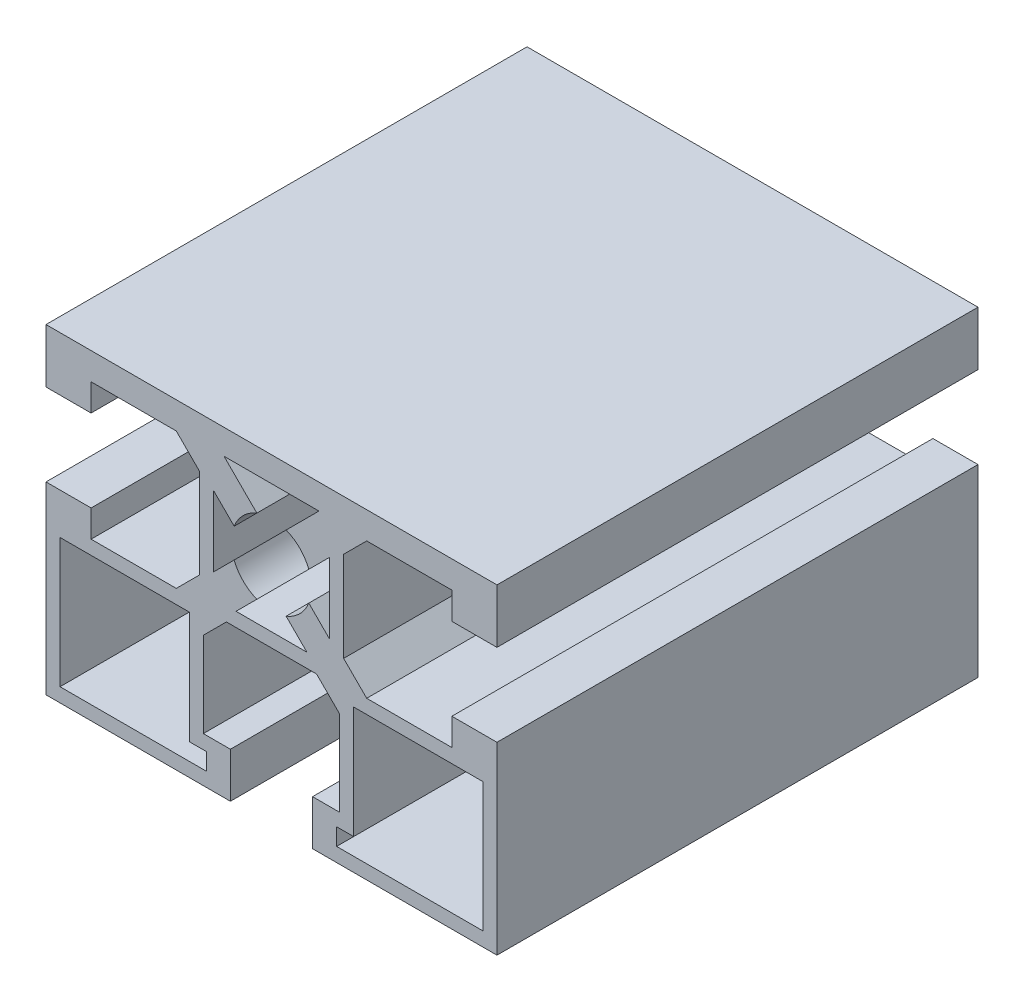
ISO-10303-21;
HEADER;
FILE_DESCRIPTION(('STEP AP214'),'2;1');
FILE_NAME('part.step','',(''),(''),'','','');
FILE_SCHEMA(('AUTOMOTIVE_DESIGN { 1 0 10303 214 1 1 1 1 }'));
ENDSEC;
DATA;
#1=APPLICATION_CONTEXT('core data for automotive mechanical design processes');
#2=APPLICATION_PROTOCOL_DEFINITION('international standard','automotive_design',2000,#1);
#3=PRODUCT_CONTEXT('',#1,'mechanical');
#4=PRODUCT('Part','Part','',(#3));
#5=PRODUCT_RELATED_PRODUCT_CATEGORY('part','',(#4));
#6=PRODUCT_DEFINITION_FORMATION('','',#4);
#7=PRODUCT_DEFINITION_CONTEXT('part definition',#1,'design');
#8=PRODUCT_DEFINITION('design','',#6,#7);
#9=PRODUCT_DEFINITION_SHAPE('','',#8);
#10=(LENGTH_UNIT() NAMED_UNIT(*) SI_UNIT(.MILLI.,.METRE.));
#11=(NAMED_UNIT(*) PLANE_ANGLE_UNIT() SI_UNIT($,.RADIAN.));
#12=(NAMED_UNIT(*) SI_UNIT($,.STERADIAN.) SOLID_ANGLE_UNIT());
#13=UNCERTAINTY_MEASURE_WITH_UNIT(LENGTH_MEASURE(1.E-05),#10,'distance_accuracy_value','');
#14=(GEOMETRIC_REPRESENTATION_CONTEXT(3) GLOBAL_UNCERTAINTY_ASSIGNED_CONTEXT((#13)) GLOBAL_UNIT_ASSIGNED_CONTEXT((#10,
#11,#12)) REPRESENTATION_CONTEXT('',''));
#15=CARTESIAN_POINT('',(0.,0.,0.));
#16=DIRECTION('',(0.,0.,1.));
#17=DIRECTION('',(1.,0.,0.));
#18=AXIS2_PLACEMENT_3D('',#15,#16,#17);
#19=CARTESIAN_POINT('',(-22.4999948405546,9.49999237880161,48.));
#20=DIRECTION('',(0.,0.,1.));
#21=DIRECTION('',(1.,0.,0.));
#22=AXIS2_PLACEMENT_3D('',#19,#20,#21);
#23=PLANE('',#22);
#24=CARTESIAN_POINT('',(-2.440270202E-12,-2.398636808E-12,48.));
#25=DIRECTION('',(0.,0.,1.));
#26=DIRECTION('',(1.,0.,0.));
#27=AXIS2_PLACEMENT_3D('',#24,#25,#26);
#28=CIRCLE('',#27,4.0005);
#29=CARTESIAN_POINT('',(3.72404648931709,1.46132747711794,48.));
#30=VERTEX_POINT('',#29);
#31=CARTESIAN_POINT('',(1.46132426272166,3.72404775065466,48.));
#32=VERTEX_POINT('',#31);
#33=EDGE_CURVE('E53',#30,#32,#28,.T.);
#34=ORIENTED_EDGE('',*,*,#33,.F.);
#35=DIRECTION('',(-0.707106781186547,-0.707106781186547,0.));
#36=VECTOR('',#35,1.);
#37=CARTESIAN_POINT('',(3.4511171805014,1.18839816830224,48.));
#38=LINE('',#37,#36);
#39=CARTESIAN_POINT('',(5.79998503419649,3.53726602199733,48.));
#40=VERTEX_POINT('',#39);
#41=EDGE_CURVE('E432',#40,#30,#38,.T.);
#42=ORIENTED_EDGE('',*,*,#41,.F.);
#43=DIRECTION('',(-2.07635365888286E-06,0.999999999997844,0.));
#44=VECTOR('',#43,1.);
#45=CARTESIAN_POINT('',(5.79998503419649,3.53726602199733,48.));
#46=LINE('',#45,#44);
#47=CARTESIAN_POINT('',(5.79999972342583,-3.5372654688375,48.));
#48=VERTEX_POINT('',#47);
#49=EDGE_CURVE('E441',#48,#40,#46,.T.);
#50=ORIENTED_EDGE('',*,*,#49,.F.);
#51=DIRECTION('',(0.707106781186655,-0.70710678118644,0.));
#52=VECTOR('',#51,1.);
#53=CARTESIAN_POINT('',(5.79999972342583,-3.5372654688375,48.));
#54=LINE('',#53,#52);
#55=CARTESIAN_POINT('',(3.72405078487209,-1.46131653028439,48.));
#56=VERTEX_POINT('',#55);
#57=EDGE_CURVE('E445',#56,#48,#54,.T.);
#58=ORIENTED_EDGE('',*,*,#57,.F.);
#59=CARTESIAN_POINT('',(1.46132426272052,-3.7240477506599,48.));
#60=VERTEX_POINT('',#59);
#61=EDGE_CURVE('E45',#60,#56,#28,.T.);
#62=ORIENTED_EDGE('',*,*,#61,.F.);
#63=DIRECTION('',(-0.707108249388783,0.707105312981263,0.));
#64=VECTOR('',#63,1.);
#65=CARTESIAN_POINT('',(1.18839399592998,-3.45111861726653,48.));
#66=LINE('',#65,#64);
#67=CARTESIAN_POINT('',(3.53727751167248,-5.79999237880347,48.));
#68=VERTEX_POINT('',#67);
#69=EDGE_CURVE('E1580',#68,#60,#66,.T.);
#70=ORIENTED_EDGE('',*,*,#69,.F.);
#71=DIRECTION('',(1.,0.,0.));
#72=VECTOR('',#71,1.);
#73=CARTESIAN_POINT('',(3.53727751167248,-5.79999237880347,48.));
#74=LINE('',#73,#72);
#75=CARTESIAN_POINT('',(-3.53727751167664,-5.79999237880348,48.));
#76=VERTEX_POINT('',#75);
#77=EDGE_CURVE('E1583',#76,#68,#74,.T.);
#78=ORIENTED_EDGE('',*,*,#77,.F.);
#79=DIRECTION('',(-0.707108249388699,-0.707105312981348,0.));
#80=VECTOR('',#79,1.);
#81=CARTESIAN_POINT('',(-3.53727751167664,-5.79999237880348,48.));
#82=LINE('',#81,#80);
#83=CARTESIAN_POINT('',(-1.46132426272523,-3.72404775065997,48.));
#84=VERTEX_POINT('',#83);
#85=EDGE_CURVE('E494',#84,#76,#82,.T.);
#86=ORIENTED_EDGE('',*,*,#85,.F.);
#87=CARTESIAN_POINT('',(-3.72405078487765,-1.46131653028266,48.));
#88=VERTEX_POINT('',#87);
#89=EDGE_CURVE('E1581',#88,#84,#28,.T.);
#90=ORIENTED_EDGE('',*,*,#89,.F.);
#91=DIRECTION('',(0.707106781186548,0.707106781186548,0.));
#92=VECTOR('',#91,1.);
#93=CARTESIAN_POINT('',(-3.45112108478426,-1.18838683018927,48.));
#94=LINE('',#93,#92);
#95=CARTESIAN_POINT('',(-5.79999972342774,-3.53726546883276,48.));
#96=VERTEX_POINT('',#95);
#97=EDGE_CURVE('E458',#96,#88,#94,.T.);
#98=ORIENTED_EDGE('',*,*,#97,.F.);
#99=DIRECTION('',(-2.07635374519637E-06,-0.999999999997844,0.));
#100=VECTOR('',#99,1.);
#101=CARTESIAN_POINT('',(-5.79999972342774,-3.53726546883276,48.));
#102=LINE('',#101,#100);
#103=CARTESIAN_POINT('',(-5.79998503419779,3.53726602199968,48.));
#104=VERTEX_POINT('',#103);
#105=EDGE_CURVE('E455',#104,#96,#102,.T.);
#106=ORIENTED_EDGE('',*,*,#105,.F.);
#107=DIRECTION('',(-0.707106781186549,0.707106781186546,0.));
#108=VECTOR('',#107,1.);
#109=CARTESIAN_POINT('',(-5.79998503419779,3.53726602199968,48.));
#110=LINE('',#109,#108);
#111=CARTESIAN_POINT('',(-3.7240464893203,1.4613274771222,48.));
#112=VERTEX_POINT('',#111);
#113=EDGE_CURVE('E453',#112,#104,#110,.T.);
#114=ORIENTED_EDGE('',*,*,#113,.F.);
#115=CARTESIAN_POINT('',(-1.4613242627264,3.72404775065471,48.));
#116=VERTEX_POINT('',#115);
#117=EDGE_CURVE('E436',#116,#112,#28,.T.);
#118=ORIENTED_EDGE('',*,*,#117,.F.);
#119=DIRECTION('',(0.707108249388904,-0.707105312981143,0.));
#120=VECTOR('',#119,1.);
#121=CARTESIAN_POINT('',(-1.18839399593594,3.45111861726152,48.));
#122=LINE('',#121,#120);
#123=CARTESIAN_POINT('',(-4.73728554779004,6.99999543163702,48.));
#124=VERTEX_POINT('',#123);
#125=EDGE_CURVE('E450',#124,#116,#122,.T.);
#126=ORIENTED_EDGE('',*,*,#125,.F.);
#127=DIRECTION('',(-1.,0.,0.));
#128=VECTOR('',#127,1.);
#129=CARTESIAN_POINT('',(-4.73728554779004,6.99999543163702,48.));
#130=LINE('',#129,#128);
#131=CARTESIAN_POINT('',(4.73728554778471,6.99999543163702,48.));
#132=VERTEX_POINT('',#131);
#133=EDGE_CURVE('E443',#132,#124,#130,.T.);
#134=ORIENTED_EDGE('',*,*,#133,.F.);
#135=DIRECTION('',(0.707108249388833,0.707105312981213,0.));
#136=VECTOR('',#135,1.);
#137=CARTESIAN_POINT('',(4.73728554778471,6.99999543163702,48.));
#138=LINE('',#137,#136);
#139=EDGE_CURVE('E434',#32,#132,#138,.T.);
#140=ORIENTED_EDGE('',*,*,#139,.F.);
#141=EDGE_LOOP('',(#34,#42,#50,#58,#62,#70,#78,#86,#90,#98,#106,#114,#118,#126,#134,#140));
#142=FACE_BOUND('',#141,.T.);
#143=DIRECTION('',(1.,0.,0.));
#144=VECTOR('',#143,1.);
#145=CARTESIAN_POINT('',(21.1000139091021,-21.0999999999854,48.));
#146=LINE('',#145,#144);
#147=CARTESIAN_POINT('',(6.50001180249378,-21.0999999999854,48.));
#148=VERTEX_POINT('',#147);
#149=CARTESIAN_POINT('',(21.1000139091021,-21.0999999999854,48.));
#150=VERTEX_POINT('',#149);
#151=EDGE_CURVE('E516',#148,#150,#146,.T.);
#152=ORIENTED_EDGE('',*,*,#151,.F.);
#153=DIRECTION('',(0.,-1.,0.));
#154=VECTOR('',#153,1.);
#155=CARTESIAN_POINT('',(6.50001180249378,-21.0999999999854,48.));
#156=LINE('',#155,#154);
#157=CARTESIAN_POINT('',(6.50001180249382,-19.4000076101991,48.));
#158=VERTEX_POINT('',#157);
#159=EDGE_CURVE('E514',#158,#148,#156,.T.);
#160=ORIENTED_EDGE('',*,*,#159,.F.);
#161=DIRECTION('',(-1.,0.,0.));
#162=VECTOR('',#161,1.);
#163=CARTESIAN_POINT('',(6.50001180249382,-19.4000076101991,48.));
#164=LINE('',#163,#162);
#165=CARTESIAN_POINT('',(8.19999589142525,-19.4000076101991,48.));
#166=VERTEX_POINT('',#165);
#167=EDGE_CURVE('E526',#166,#158,#164,.T.);
#168=ORIENTED_EDGE('',*,*,#167,.F.);
#169=DIRECTION('',(-1.20056300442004E-06,-0.999999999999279,0.));
#170=VECTOR('',#169,1.);
#171=CARTESIAN_POINT('',(8.19999589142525,-19.4000076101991,48.));
#172=LINE('',#171,#170);
#173=CARTESIAN_POINT('',(8.20000933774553,-8.19999542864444,48.));
#174=VERTEX_POINT('',#173);
#175=EDGE_CURVE('E523',#174,#166,#172,.T.);
#176=ORIENTED_EDGE('',*,*,#175,.F.);
#177=DIRECTION('',(-1.,0.,0.));
#178=VECTOR('',#177,1.);
#179=CARTESIAN_POINT('',(8.20000933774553,-8.19999542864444,48.));
#180=LINE('',#179,#178);
#181=CARTESIAN_POINT('',(21.1000139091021,-8.19999542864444,48.));
#182=VERTEX_POINT('',#181);
#183=EDGE_CURVE('E521',#182,#174,#180,.T.);
#184=ORIENTED_EDGE('',*,*,#183,.F.);
#185=DIRECTION('',(0.,1.,0.));
#186=VECTOR('',#185,1.);
#187=CARTESIAN_POINT('',(21.1000139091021,-8.19999542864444,48.));
#188=LINE('',#187,#186);
#189=EDGE_CURVE('E519',#150,#182,#188,.T.);
#190=ORIENTED_EDGE('',*,*,#189,.F.);
#191=EDGE_LOOP('',(#152,#160,#168,#176,#184,#190));
#192=FACE_BOUND('',#191,.T.);
#193=DIRECTION('',(-1.,0.,0.));
#194=VECTOR('',#193,1.);
#195=CARTESIAN_POINT('',(22.5000051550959,9.49999237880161,48.));
#196=LINE('',#195,#194);
#197=CARTESIAN_POINT('',(22.5000051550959,9.49999237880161,48.));
#198=VERTEX_POINT('',#197);
#199=CARTESIAN_POINT('',(-22.4999948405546,9.49999237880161,48.));
#200=VERTEX_POINT('',#199);
#201=EDGE_CURVE('E604',#198,#200,#196,.T.);
#202=ORIENTED_EDGE('',*,*,#201,.T.);
#203=DIRECTION('',(0.,-1.,0.));
#204=VECTOR('',#203,1.);
#205=CARTESIAN_POINT('',(-22.4999948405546,9.49999237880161,48.));
#206=LINE('',#205,#204);
#207=CARTESIAN_POINT('',(-22.4999948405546,4.09999239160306,48.));
#208=VERTEX_POINT('',#207);
#209=EDGE_CURVE('E607',#200,#208,#206,.T.);
#210=ORIENTED_EDGE('',*,*,#209,.T.);
#211=DIRECTION('',(1.,0.,0.));
#212=VECTOR('',#211,1.);
#213=CARTESIAN_POINT('',(-22.4999948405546,4.09999239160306,48.));
#214=LINE('',#213,#212);
#215=CARTESIAN_POINT('',(-17.9999948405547,4.09999239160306,48.));
#216=VERTEX_POINT('',#215);
#217=EDGE_CURVE('E610',#208,#216,#214,.T.);
#218=ORIENTED_EDGE('',*,*,#217,.T.);
#219=DIRECTION('',(0.,1.,0.));
#220=VECTOR('',#219,1.);
#221=CARTESIAN_POINT('',(-17.9999948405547,4.09999239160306,48.));
#222=LINE('',#221,#220);
#223=CARTESIAN_POINT('',(-17.9999948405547,6.79999239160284,48.));
#224=VERTEX_POINT('',#223);
#225=EDGE_CURVE('E612',#216,#224,#222,.T.);
#226=ORIENTED_EDGE('',*,*,#225,.T.);
#227=DIRECTION('',(1.,0.,0.));
#228=VECTOR('',#227,1.);
#229=CARTESIAN_POINT('',(-17.9999948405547,6.79999239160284,48.));
#230=LINE('',#229,#228);
#231=CARTESIAN_POINT('',(-9.49999484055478,6.79999239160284,48.));
#232=VERTEX_POINT('',#231);
#233=EDGE_CURVE('E614',#224,#232,#230,.T.);
#234=ORIENTED_EDGE('',*,*,#233,.T.);
#235=DIRECTION('',(0.707106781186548,-0.707106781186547,0.));
#236=VECTOR('',#235,1.);
#237=CARTESIAN_POINT('',(-9.49999484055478,6.79999239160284,48.));
#238=LINE('',#237,#236);
#239=CARTESIAN_POINT('',(-7.19999484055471,4.49999239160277,48.));
#240=VERTEX_POINT('',#239);
#241=EDGE_CURVE('E616',#232,#240,#238,.T.);
#242=ORIENTED_EDGE('',*,*,#241,.T.);
#243=DIRECTION('',(0.,-1.,0.));
#244=VECTOR('',#243,1.);
#245=CARTESIAN_POINT('',(-7.19999484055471,4.49999239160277,48.));
#246=LINE('',#245,#244);
#247=CARTESIAN_POINT('',(-7.19999484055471,-4.50000760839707,48.));
#248=VERTEX_POINT('',#247);
#249=EDGE_CURVE('E618',#240,#248,#246,.T.);
#250=ORIENTED_EDGE('',*,*,#249,.T.);
#251=DIRECTION('',(-0.707106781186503,-0.707106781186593,0.));
#252=VECTOR('',#251,1.);
#253=CARTESIAN_POINT('',(-7.19999484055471,-4.50000760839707,48.));
#254=LINE('',#253,#252);
#255=CARTESIAN_POINT('',(-9.49999484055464,-6.80000760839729,48.));
#256=VERTEX_POINT('',#255);
#257=EDGE_CURVE('E620',#248,#256,#254,.T.);
#258=ORIENTED_EDGE('',*,*,#257,.T.);
#259=DIRECTION('',(-1.,0.,0.));
#260=VECTOR('',#259,1.);
#261=CARTESIAN_POINT('',(-9.49999484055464,-6.80000760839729,48.));
#262=LINE('',#261,#260);
#263=CARTESIAN_POINT('',(-17.9999948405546,-6.800007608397,48.));
#264=VERTEX_POINT('',#263);
#265=EDGE_CURVE('E622',#256,#264,#262,.T.);
#266=ORIENTED_EDGE('',*,*,#265,.T.);
#267=DIRECTION('',(0.,1.,0.));
#268=VECTOR('',#267,1.);
#269=CARTESIAN_POINT('',(-17.9999948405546,-6.800007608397,48.));
#270=LINE('',#269,#268);
#271=CARTESIAN_POINT('',(-17.9999948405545,-4.10000760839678,48.));
#272=VERTEX_POINT('',#271);
#273=EDGE_CURVE('E624',#264,#272,#270,.T.);
#274=ORIENTED_EDGE('',*,*,#273,.T.);
#275=DIRECTION('',(-1.,0.,0.));
#276=VECTOR('',#275,1.);
#277=CARTESIAN_POINT('',(-17.9999948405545,-4.10000760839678,48.));
#278=LINE('',#277,#276);
#279=CARTESIAN_POINT('',(-22.4999948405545,-4.10000760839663,48.));
#280=VERTEX_POINT('',#279);
#281=EDGE_CURVE('E626',#272,#280,#278,.T.);
#282=ORIENTED_EDGE('',*,*,#281,.T.);
#283=DIRECTION('',(0.,-1.,0.));
#284=VECTOR('',#283,1.);
#285=CARTESIAN_POINT('',(-22.4999948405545,-4.10000760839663,48.));
#286=LINE('',#285,#284);
#287=CARTESIAN_POINT('',(-22.4999948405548,-22.5000076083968,48.));
#288=VERTEX_POINT('',#287);
#289=EDGE_CURVE('E628',#280,#288,#286,.T.);
#290=ORIENTED_EDGE('',*,*,#289,.T.);
#291=DIRECTION('',(1.,0.,0.));
#292=VECTOR('',#291,1.);
#293=CARTESIAN_POINT('',(-22.4999948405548,-22.5000076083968,48.));
#294=LINE('',#293,#292);
#295=CARTESIAN_POINT('',(-4.09999484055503,-22.5000076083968,48.));
#296=VERTEX_POINT('',#295);
#297=EDGE_CURVE('E630',#288,#296,#294,.T.);
#298=ORIENTED_EDGE('',*,*,#297,.T.);
#299=DIRECTION('',(0.,1.,0.));
#300=VECTOR('',#299,1.);
#301=CARTESIAN_POINT('',(-4.09999484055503,-22.5000076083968,48.));
#302=LINE('',#301,#300);
#303=CARTESIAN_POINT('',(-4.09999484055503,-18.000007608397,48.));
#304=VERTEX_POINT('',#303);
#305=EDGE_CURVE('E632',#296,#304,#302,.T.);
#306=ORIENTED_EDGE('',*,*,#305,.T.);
#307=DIRECTION('',(-1.,0.,0.));
#308=VECTOR('',#307,1.);
#309=CARTESIAN_POINT('',(-4.09999484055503,-18.000007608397,48.));
#310=LINE('',#309,#308);
#311=CARTESIAN_POINT('',(-6.79999484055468,-18.000007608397,48.));
#312=VERTEX_POINT('',#311);
#313=EDGE_CURVE('E634',#304,#312,#310,.T.);
#314=ORIENTED_EDGE('',*,*,#313,.T.);
#315=DIRECTION('',(0.,1.,0.));
#316=VECTOR('',#315,1.);
#317=CARTESIAN_POINT('',(-6.79999484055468,-18.000007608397,48.));
#318=LINE('',#317,#316);
#319=CARTESIAN_POINT('',(-6.79999484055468,-9.50000760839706,48.));
#320=VERTEX_POINT('',#319);
#321=EDGE_CURVE('E636',#312,#320,#318,.T.);
#322=ORIENTED_EDGE('',*,*,#321,.T.);
#323=DIRECTION('',(0.707106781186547,0.707106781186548,0.));
#324=VECTOR('',#323,1.);
#325=CARTESIAN_POINT('',(-6.79999484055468,-9.50000760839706,48.));
#326=LINE('',#325,#324);
#327=CARTESIAN_POINT('',(-4.49999484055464,-7.20000760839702,48.));
#328=VERTEX_POINT('',#327);
#329=EDGE_CURVE('E638',#320,#328,#326,.T.);
#330=ORIENTED_EDGE('',*,*,#329,.T.);
#331=DIRECTION('',(1.,0.,0.));
#332=VECTOR('',#331,1.);
#333=CARTESIAN_POINT('',(-4.49999484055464,-7.20000760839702,48.));
#334=LINE('',#333,#332);
#335=CARTESIAN_POINT('',(4.50000515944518,-7.20000760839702,48.));
#336=VERTEX_POINT('',#335);
#337=EDGE_CURVE('E640',#328,#336,#334,.T.);
#338=ORIENTED_EDGE('',*,*,#337,.T.);
#339=DIRECTION('',(0.707106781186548,-0.707106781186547,0.));
#340=VECTOR('',#339,1.);
#341=CARTESIAN_POINT('',(4.50000515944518,-7.20000760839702,48.));
#342=LINE('',#341,#340);
#343=CARTESIAN_POINT('',(6.80000515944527,-9.50000760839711,48.));
#344=VERTEX_POINT('',#343);
#345=EDGE_CURVE('E642',#336,#344,#342,.T.);
#346=ORIENTED_EDGE('',*,*,#345,.T.);
#347=DIRECTION('',(0.,-1.,0.));
#348=VECTOR('',#347,1.);
#349=CARTESIAN_POINT('',(6.80000515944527,-9.50000760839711,48.));
#350=LINE('',#349,#348);
#351=CARTESIAN_POINT('',(6.80000515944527,-18.000007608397,48.));
#352=VERTEX_POINT('',#351);
#353=EDGE_CURVE('E644',#344,#352,#350,.T.);
#354=ORIENTED_EDGE('',*,*,#353,.T.);
#355=DIRECTION('',(-1.,0.,0.));
#356=VECTOR('',#355,1.);
#357=CARTESIAN_POINT('',(6.80000515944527,-18.000007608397,48.));
#358=LINE('',#357,#356);
#359=CARTESIAN_POINT('',(4.10000515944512,-18.000007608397,48.));
#360=VERTEX_POINT('',#359);
#361=EDGE_CURVE('E646',#352,#360,#358,.T.);
#362=ORIENTED_EDGE('',*,*,#361,.T.);
#363=DIRECTION('',(0.,-1.,0.));
#364=VECTOR('',#363,1.);
#365=CARTESIAN_POINT('',(4.10000515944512,-18.000007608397,48.));
#366=LINE('',#365,#364);
#367=CARTESIAN_POINT('',(4.10000515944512,-22.5000076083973,48.));
#368=VERTEX_POINT('',#367);
#369=EDGE_CURVE('E648',#360,#368,#366,.T.);
#370=ORIENTED_EDGE('',*,*,#369,.T.);
#371=DIRECTION('',(1.,0.,0.));
#372=VECTOR('',#371,1.);
#373=CARTESIAN_POINT('',(4.10000515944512,-22.5000076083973,48.));
#374=LINE('',#373,#372);
#375=CARTESIAN_POINT('',(22.500005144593,-22.5000076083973,48.));
#376=VERTEX_POINT('',#375);
#377=EDGE_CURVE('E650',#368,#376,#374,.T.);
#378=ORIENTED_EDGE('',*,*,#377,.T.);
#379=DIRECTION('',(0.,1.,0.));
#380=VECTOR('',#379,1.);
#381=CARTESIAN_POINT('',(22.500005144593,-22.5000076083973,48.));
#382=LINE('',#381,#380);
#383=CARTESIAN_POINT('',(22.500005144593,-4.10000760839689,48.));
#384=VERTEX_POINT('',#383);
#385=EDGE_CURVE('E652',#376,#384,#382,.T.);
#386=ORIENTED_EDGE('',*,*,#385,.T.);
#387=DIRECTION('',(-1.,0.,0.));
#388=VECTOR('',#387,1.);
#389=CARTESIAN_POINT('',(22.500005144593,-4.10000760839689,48.));
#390=LINE('',#389,#388);
#391=CARTESIAN_POINT('',(18.0000051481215,-4.10000760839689,48.));
#392=VERTEX_POINT('',#391);
#393=EDGE_CURVE('E654',#384,#392,#390,.T.);
#394=ORIENTED_EDGE('',*,*,#393,.T.);
#395=DIRECTION('',(0.,-1.,0.));
#396=VECTOR('',#395,1.);
#397=CARTESIAN_POINT('',(18.0000051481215,-4.10000760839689,48.));
#398=LINE('',#397,#396);
#399=CARTESIAN_POINT('',(18.0000051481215,-6.8000076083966,48.));
#400=VERTEX_POINT('',#399);
#401=EDGE_CURVE('E656',#392,#400,#398,.T.);
#402=ORIENTED_EDGE('',*,*,#401,.T.);
#403=DIRECTION('',(-1.,0.,0.));
#404=VECTOR('',#403,1.);
#405=CARTESIAN_POINT('',(18.0000051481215,-6.8000076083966,48.));
#406=LINE('',#405,#404);
#407=CARTESIAN_POINT('',(9.5000051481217,-6.8000076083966,48.));
#408=VERTEX_POINT('',#407);
#409=EDGE_CURVE('E658',#400,#408,#406,.T.);
#410=ORIENTED_EDGE('',*,*,#409,.T.);
#411=DIRECTION('',(-0.707106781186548,0.707106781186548,0.));
#412=VECTOR('',#411,1.);
#413=CARTESIAN_POINT('',(9.5000051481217,-6.8000076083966,48.));
#414=LINE('',#413,#412);
#415=CARTESIAN_POINT('',(7.20000514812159,-4.5000076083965,48.));
#416=VERTEX_POINT('',#415);
#417=EDGE_CURVE('E660',#408,#416,#414,.T.);
#418=ORIENTED_EDGE('',*,*,#417,.T.);
#419=DIRECTION('',(0.,1.,0.));
#420=VECTOR('',#419,1.);
#421=CARTESIAN_POINT('',(7.20000514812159,-4.5000076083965,48.));
#422=LINE('',#421,#420);
#423=CARTESIAN_POINT('',(7.20000514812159,4.49999239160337,48.));
#424=VERTEX_POINT('',#423);
#425=EDGE_CURVE('E662',#416,#424,#422,.T.);
#426=ORIENTED_EDGE('',*,*,#425,.T.);
#427=DIRECTION('',(0.707106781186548,0.707106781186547,0.));
#428=VECTOR('',#427,1.);
#429=CARTESIAN_POINT('',(7.20000514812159,4.49999239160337,48.));
#430=LINE('',#429,#428);
#431=CARTESIAN_POINT('',(9.50000514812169,6.79999239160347,48.));
#432=VERTEX_POINT('',#431);
#433=EDGE_CURVE('E664',#424,#432,#430,.T.);
#434=ORIENTED_EDGE('',*,*,#433,.T.);
#435=DIRECTION('',(1.,0.,0.));
#436=VECTOR('',#435,1.);
#437=CARTESIAN_POINT('',(9.50000514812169,6.79999239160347,48.));
#438=LINE('',#437,#436);
#439=CARTESIAN_POINT('',(18.0000051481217,6.79999239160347,48.));
#440=VERTEX_POINT('',#439);
#441=EDGE_CURVE('E666',#432,#440,#438,.T.);
#442=ORIENTED_EDGE('',*,*,#441,.T.);
#443=DIRECTION('',(0.,-1.,0.));
#444=VECTOR('',#443,1.);
#445=CARTESIAN_POINT('',(18.0000051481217,6.79999239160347,48.));
#446=LINE('',#445,#444);
#447=CARTESIAN_POINT('',(18.0000051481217,4.09999239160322,48.));
#448=VERTEX_POINT('',#447);
#449=EDGE_CURVE('E668',#440,#448,#446,.T.);
#450=ORIENTED_EDGE('',*,*,#449,.T.);
#451=DIRECTION('',(1.,0.,0.));
#452=VECTOR('',#451,1.);
#453=CARTESIAN_POINT('',(18.0000051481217,4.09999239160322,48.));
#454=LINE('',#453,#452);
#455=CARTESIAN_POINT('',(22.5000051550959,4.09999239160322,48.));
#456=VERTEX_POINT('',#455);
#457=EDGE_CURVE('E670',#448,#456,#454,.T.);
#458=ORIENTED_EDGE('',*,*,#457,.T.);
#459=DIRECTION('',(0.,1.,0.));
#460=VECTOR('',#459,1.);
#461=CARTESIAN_POINT('',(22.5000051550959,4.09999239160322,48.));
#462=LINE('',#461,#460);
#463=EDGE_CURVE('E672',#456,#198,#462,.T.);
#464=ORIENTED_EDGE('',*,*,#463,.T.);
#465=EDGE_LOOP('',(#202,#210,#218,#226,#234,#242,#250,#258,#266,#274,#282,#290,#298,#306,#314,
#322,#330,#338,#346,#354,#362,#370,#378,#386,#394,#402,#410,#418,#426,#434,#442,#450,#458,#464));
#466=FACE_BOUND('',#465,.T.);
#467=DIRECTION('',(-1.,0.,0.));
#468=VECTOR('',#467,1.);
#469=CARTESIAN_POINT('',(-21.1000036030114,-8.19999542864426,48.));
#470=LINE('',#469,#468);
#471=CARTESIAN_POINT('',(-8.19999903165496,-8.19999542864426,48.));
#472=VERTEX_POINT('',#471);
#473=CARTESIAN_POINT('',(-21.1000036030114,-8.19999542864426,48.));
#474=VERTEX_POINT('',#473);
#475=EDGE_CURVE('E561',#472,#474,#470,.T.);
#476=ORIENTED_EDGE('',*,*,#475,.F.);
#477=DIRECTION('',(-1.20056301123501E-06,0.999999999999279,0.));
#478=VECTOR('',#477,1.);
#479=CARTESIAN_POINT('',(-8.19999903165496,-8.19999542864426,48.));
#480=LINE('',#479,#478);
#481=CARTESIAN_POINT('',(-8.19998558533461,-19.400007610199,48.));
#482=VERTEX_POINT('',#481);
#483=EDGE_CURVE('E559',#482,#472,#480,.T.);
#484=ORIENTED_EDGE('',*,*,#483,.F.);
#485=DIRECTION('',(-1.,0.,0.));
#486=VECTOR('',#485,1.);
#487=CARTESIAN_POINT('',(-8.19998558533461,-19.400007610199,48.));
#488=LINE('',#487,#486);
#489=CARTESIAN_POINT('',(-6.50000149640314,-19.400007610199,48.));
#490=VERTEX_POINT('',#489);
#491=EDGE_CURVE('E571',#490,#482,#488,.T.);
#492=ORIENTED_EDGE('',*,*,#491,.F.);
#493=DIRECTION('',(0.,1.,0.));
#494=VECTOR('',#493,1.);
#495=CARTESIAN_POINT('',(-6.50000149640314,-19.400007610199,48.));
#496=LINE('',#495,#494);
#497=CARTESIAN_POINT('',(-6.50000149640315,-21.1000000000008,48.));
#498=VERTEX_POINT('',#497);
#499=EDGE_CURVE('E568',#498,#490,#496,.T.);
#500=ORIENTED_EDGE('',*,*,#499,.F.);
#501=DIRECTION('',(1.,0.,0.));
#502=VECTOR('',#501,1.);
#503=CARTESIAN_POINT('',(-6.50000149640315,-21.1000000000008,48.));
#504=LINE('',#503,#502);
#505=CARTESIAN_POINT('',(-21.1000036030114,-21.1000000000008,48.));
#506=VERTEX_POINT('',#505);
#507=EDGE_CURVE('E566',#506,#498,#504,.T.);
#508=ORIENTED_EDGE('',*,*,#507,.F.);
#509=DIRECTION('',(0.,-1.,0.));
#510=VECTOR('',#509,1.);
#511=CARTESIAN_POINT('',(-21.1000036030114,-21.1000000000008,48.));
#512=LINE('',#511,#510);
#513=EDGE_CURVE('E564',#474,#506,#512,.T.);
#514=ORIENTED_EDGE('',*,*,#513,.F.);
#515=EDGE_LOOP('',(#476,#484,#492,#500,#508,#514));
#516=FACE_BOUND('',#515,.T.);
#517=ADVANCED_FACE('F30',(#142,#192,#466,#516),#23,.T.);
#518=CARTESIAN_POINT('',(-22.4999948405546,9.49999237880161,0.));
#519=DIRECTION('',(0.,0.,1.));
#520=DIRECTION('',(1.,0.,0.));
#521=AXIS2_PLACEMENT_3D('',#518,#519,#520);
#522=PLANE('',#521);
#523=DIRECTION('',(0.,-1.,0.));
#524=VECTOR('',#523,1.);
#525=CARTESIAN_POINT('',(6.50001180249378,-21.0999999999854,0.));
#526=LINE('',#525,#524);
#527=CARTESIAN_POINT('',(6.50001180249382,-19.4000076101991,0.));
#528=VERTEX_POINT('',#527);
#529=CARTESIAN_POINT('',(6.50001180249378,-21.0999999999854,0.));
#530=VERTEX_POINT('',#529);
#531=EDGE_CURVE('E513',#528,#530,#526,.T.);
#532=ORIENTED_EDGE('',*,*,#531,.T.);
#533=DIRECTION('',(1.,0.,0.));
#534=VECTOR('',#533,1.);
#535=CARTESIAN_POINT('',(21.1000139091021,-21.0999999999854,0.));
#536=LINE('',#535,#534);
#537=CARTESIAN_POINT('',(21.1000139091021,-21.0999999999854,0.));
#538=VERTEX_POINT('',#537);
#539=EDGE_CURVE('E531',#530,#538,#536,.T.);
#540=ORIENTED_EDGE('',*,*,#539,.T.);
#541=DIRECTION('',(0.,1.,0.));
#542=VECTOR('',#541,1.);
#543=CARTESIAN_POINT('',(21.1000139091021,-8.19999542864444,0.));
#544=LINE('',#543,#542);
#545=CARTESIAN_POINT('',(21.1000139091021,-8.19999542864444,0.));
#546=VERTEX_POINT('',#545);
#547=EDGE_CURVE('E534',#538,#546,#544,.T.);
#548=ORIENTED_EDGE('',*,*,#547,.T.);
#549=DIRECTION('',(-1.,0.,0.));
#550=VECTOR('',#549,1.);
#551=CARTESIAN_POINT('',(8.20000933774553,-8.19999542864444,0.));
#552=LINE('',#551,#550);
#553=CARTESIAN_POINT('',(8.20000933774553,-8.19999542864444,0.));
#554=VERTEX_POINT('',#553);
#555=EDGE_CURVE('E537',#546,#554,#552,.T.);
#556=ORIENTED_EDGE('',*,*,#555,.T.);
#557=DIRECTION('',(-1.20056300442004E-06,-0.999999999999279,0.));
#558=VECTOR('',#557,1.);
#559=CARTESIAN_POINT('',(8.19999589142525,-19.4000076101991,0.));
#560=LINE('',#559,#558);
#561=CARTESIAN_POINT('',(8.19999589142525,-19.4000076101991,0.));
#562=VERTEX_POINT('',#561);
#563=EDGE_CURVE('E540',#554,#562,#560,.T.);
#564=ORIENTED_EDGE('',*,*,#563,.T.);
#565=DIRECTION('',(-1.,0.,0.));
#566=VECTOR('',#565,1.);
#567=CARTESIAN_POINT('',(6.50001180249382,-19.4000076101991,0.));
#568=LINE('',#567,#566);
#569=EDGE_CURVE('E517',#562,#528,#568,.T.);
#570=ORIENTED_EDGE('',*,*,#569,.T.);
#571=EDGE_LOOP('',(#532,#540,#548,#556,#564,#570));
#572=FACE_BOUND('',#571,.T.);
#573=DIRECTION('',(-1.,0.,0.));
#574=VECTOR('',#573,1.);
#575=CARTESIAN_POINT('',(22.5000051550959,9.49999237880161,0.));
#576=LINE('',#575,#574);
#577=CARTESIAN_POINT('',(22.5000051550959,9.49999237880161,0.));
#578=VERTEX_POINT('',#577);
#579=CARTESIAN_POINT('',(-22.4999948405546,9.49999237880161,0.));
#580=VERTEX_POINT('',#579);
#581=EDGE_CURVE('E603',#578,#580,#576,.T.);
#582=ORIENTED_EDGE('',*,*,#581,.F.);
#583=DIRECTION('',(0.,1.,0.));
#584=VECTOR('',#583,1.);
#585=CARTESIAN_POINT('',(22.5000051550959,4.09999239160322,0.));
#586=LINE('',#585,#584);
#587=CARTESIAN_POINT('',(22.5000051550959,4.09999239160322,0.));
#588=VERTEX_POINT('',#587);
#589=EDGE_CURVE('E608',#588,#578,#586,.T.);
#590=ORIENTED_EDGE('',*,*,#589,.F.);
#591=DIRECTION('',(1.,0.,0.));
#592=VECTOR('',#591,1.);
#593=CARTESIAN_POINT('',(18.0000051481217,4.09999239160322,0.));
#594=LINE('',#593,#592);
#595=CARTESIAN_POINT('',(18.0000051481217,4.09999239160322,0.));
#596=VERTEX_POINT('',#595);
#597=EDGE_CURVE('E739',#596,#588,#594,.T.);
#598=ORIENTED_EDGE('',*,*,#597,.F.);
#599=DIRECTION('',(0.,-1.,0.));
#600=VECTOR('',#599,1.);
#601=CARTESIAN_POINT('',(18.0000051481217,6.79999239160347,0.));
#602=LINE('',#601,#600);
#603=CARTESIAN_POINT('',(18.0000051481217,6.79999239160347,0.));
#604=VERTEX_POINT('',#603);
#605=EDGE_CURVE('E737',#604,#596,#602,.T.);
#606=ORIENTED_EDGE('',*,*,#605,.F.);
#607=DIRECTION('',(1.,0.,0.));
#608=VECTOR('',#607,1.);
#609=CARTESIAN_POINT('',(9.50000514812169,6.79999239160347,0.));
#610=LINE('',#609,#608);
#611=CARTESIAN_POINT('',(9.50000514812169,6.79999239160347,0.));
#612=VERTEX_POINT('',#611);
#613=EDGE_CURVE('E735',#612,#604,#610,.T.);
#614=ORIENTED_EDGE('',*,*,#613,.F.);
#615=DIRECTION('',(0.707106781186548,0.707106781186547,0.));
#616=VECTOR('',#615,1.);
#617=CARTESIAN_POINT('',(7.20000514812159,4.49999239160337,0.));
#618=LINE('',#617,#616);
#619=CARTESIAN_POINT('',(7.20000514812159,4.49999239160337,0.));
#620=VERTEX_POINT('',#619);
#621=EDGE_CURVE('E733',#620,#612,#618,.T.);
#622=ORIENTED_EDGE('',*,*,#621,.F.);
#623=DIRECTION('',(0.,1.,0.));
#624=VECTOR('',#623,1.);
#625=CARTESIAN_POINT('',(7.20000514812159,-4.5000076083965,0.));
#626=LINE('',#625,#624);
#627=CARTESIAN_POINT('',(7.20000514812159,-4.5000076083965,0.));
#628=VERTEX_POINT('',#627);
#629=EDGE_CURVE('E731',#628,#620,#626,.T.);
#630=ORIENTED_EDGE('',*,*,#629,.F.);
#631=DIRECTION('',(-0.707106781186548,0.707106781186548,0.));
#632=VECTOR('',#631,1.);
#633=CARTESIAN_POINT('',(9.5000051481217,-6.8000076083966,0.));
#634=LINE('',#633,#632);
#635=CARTESIAN_POINT('',(9.5000051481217,-6.8000076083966,0.));
#636=VERTEX_POINT('',#635);
#637=EDGE_CURVE('E729',#636,#628,#634,.T.);
#638=ORIENTED_EDGE('',*,*,#637,.F.);
#639=DIRECTION('',(-1.,0.,0.));
#640=VECTOR('',#639,1.);
#641=CARTESIAN_POINT('',(18.0000051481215,-6.8000076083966,0.));
#642=LINE('',#641,#640);
#643=CARTESIAN_POINT('',(18.0000051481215,-6.8000076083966,0.));
#644=VERTEX_POINT('',#643);
#645=EDGE_CURVE('E727',#644,#636,#642,.T.);
#646=ORIENTED_EDGE('',*,*,#645,.F.);
#647=DIRECTION('',(0.,-1.,0.));
#648=VECTOR('',#647,1.);
#649=CARTESIAN_POINT('',(18.0000051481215,-4.10000760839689,0.));
#650=LINE('',#649,#648);
#651=CARTESIAN_POINT('',(18.0000051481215,-4.10000760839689,0.));
#652=VERTEX_POINT('',#651);
#653=EDGE_CURVE('E725',#652,#644,#650,.T.);
#654=ORIENTED_EDGE('',*,*,#653,.F.);
#655=DIRECTION('',(-1.,0.,0.));
#656=VECTOR('',#655,1.);
#657=CARTESIAN_POINT('',(22.500005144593,-4.10000760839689,0.));
#658=LINE('',#657,#656);
#659=CARTESIAN_POINT('',(22.500005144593,-4.10000760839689,0.));
#660=VERTEX_POINT('',#659);
#661=EDGE_CURVE('E723',#660,#652,#658,.T.);
#662=ORIENTED_EDGE('',*,*,#661,.F.);
#663=DIRECTION('',(0.,1.,0.));
#664=VECTOR('',#663,1.);
#665=CARTESIAN_POINT('',(22.500005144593,-22.5000076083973,0.));
#666=LINE('',#665,#664);
#667=CARTESIAN_POINT('',(22.500005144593,-22.5000076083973,0.));
#668=VERTEX_POINT('',#667);
#669=EDGE_CURVE('E721',#668,#660,#666,.T.);
#670=ORIENTED_EDGE('',*,*,#669,.F.);
#671=DIRECTION('',(1.,0.,0.));
#672=VECTOR('',#671,1.);
#673=CARTESIAN_POINT('',(4.10000515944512,-22.5000076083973,0.));
#674=LINE('',#673,#672);
#675=CARTESIAN_POINT('',(4.10000515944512,-22.5000076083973,0.));
#676=VERTEX_POINT('',#675);
#677=EDGE_CURVE('E719',#676,#668,#674,.T.);
#678=ORIENTED_EDGE('',*,*,#677,.F.);
#679=DIRECTION('',(0.,-1.,0.));
#680=VECTOR('',#679,1.);
#681=CARTESIAN_POINT('',(4.10000515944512,-18.000007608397,0.));
#682=LINE('',#681,#680);
#683=CARTESIAN_POINT('',(4.10000515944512,-18.000007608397,0.));
#684=VERTEX_POINT('',#683);
#685=EDGE_CURVE('E717',#684,#676,#682,.T.);
#686=ORIENTED_EDGE('',*,*,#685,.F.);
#687=DIRECTION('',(-1.,0.,0.));
#688=VECTOR('',#687,1.);
#689=CARTESIAN_POINT('',(6.80000515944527,-18.000007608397,0.));
#690=LINE('',#689,#688);
#691=CARTESIAN_POINT('',(6.80000515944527,-18.000007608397,0.));
#692=VERTEX_POINT('',#691);
#693=EDGE_CURVE('E715',#692,#684,#690,.T.);
#694=ORIENTED_EDGE('',*,*,#693,.F.);
#695=DIRECTION('',(0.,-1.,0.));
#696=VECTOR('',#695,1.);
#697=CARTESIAN_POINT('',(6.80000515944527,-9.50000760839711,0.));
#698=LINE('',#697,#696);
#699=CARTESIAN_POINT('',(6.80000515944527,-9.50000760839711,0.));
#700=VERTEX_POINT('',#699);
#701=EDGE_CURVE('E713',#700,#692,#698,.T.);
#702=ORIENTED_EDGE('',*,*,#701,.F.);
#703=DIRECTION('',(0.707106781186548,-0.707106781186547,0.));
#704=VECTOR('',#703,1.);
#705=CARTESIAN_POINT('',(4.50000515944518,-7.20000760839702,0.));
#706=LINE('',#705,#704);
#707=CARTESIAN_POINT('',(4.50000515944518,-7.20000760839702,0.));
#708=VERTEX_POINT('',#707);
#709=EDGE_CURVE('E711',#708,#700,#706,.T.);
#710=ORIENTED_EDGE('',*,*,#709,.F.);
#711=DIRECTION('',(1.,0.,0.));
#712=VECTOR('',#711,1.);
#713=CARTESIAN_POINT('',(-4.49999484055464,-7.20000760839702,0.));
#714=LINE('',#713,#712);
#715=CARTESIAN_POINT('',(-4.49999484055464,-7.20000760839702,0.));
#716=VERTEX_POINT('',#715);
#717=EDGE_CURVE('E709',#716,#708,#714,.T.);
#718=ORIENTED_EDGE('',*,*,#717,.F.);
#719=DIRECTION('',(0.707106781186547,0.707106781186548,0.));
#720=VECTOR('',#719,1.);
#721=CARTESIAN_POINT('',(-6.79999484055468,-9.50000760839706,0.));
#722=LINE('',#721,#720);
#723=CARTESIAN_POINT('',(-6.79999484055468,-9.50000760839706,0.));
#724=VERTEX_POINT('',#723);
#725=EDGE_CURVE('E707',#724,#716,#722,.T.);
#726=ORIENTED_EDGE('',*,*,#725,.F.);
#727=DIRECTION('',(0.,1.,0.));
#728=VECTOR('',#727,1.);
#729=CARTESIAN_POINT('',(-6.79999484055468,-18.000007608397,0.));
#730=LINE('',#729,#728);
#731=CARTESIAN_POINT('',(-6.79999484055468,-18.000007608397,0.));
#732=VERTEX_POINT('',#731);
#733=EDGE_CURVE('E705',#732,#724,#730,.T.);
#734=ORIENTED_EDGE('',*,*,#733,.F.);
#735=DIRECTION('',(-1.,0.,0.));
#736=VECTOR('',#735,1.);
#737=CARTESIAN_POINT('',(-4.09999484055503,-18.000007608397,0.));
#738=LINE('',#737,#736);
#739=CARTESIAN_POINT('',(-4.09999484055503,-18.000007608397,0.));
#740=VERTEX_POINT('',#739);
#741=EDGE_CURVE('E703',#740,#732,#738,.T.);
#742=ORIENTED_EDGE('',*,*,#741,.F.);
#743=DIRECTION('',(0.,1.,0.));
#744=VECTOR('',#743,1.);
#745=CARTESIAN_POINT('',(-4.09999484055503,-22.5000076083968,0.));
#746=LINE('',#745,#744);
#747=CARTESIAN_POINT('',(-4.09999484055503,-22.5000076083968,0.));
#748=VERTEX_POINT('',#747);
#749=EDGE_CURVE('E701',#748,#740,#746,.T.);
#750=ORIENTED_EDGE('',*,*,#749,.F.);
#751=DIRECTION('',(1.,0.,0.));
#752=VECTOR('',#751,1.);
#753=CARTESIAN_POINT('',(-22.4999948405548,-22.5000076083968,0.));
#754=LINE('',#753,#752);
#755=CARTESIAN_POINT('',(-22.4999948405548,-22.5000076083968,0.));
#756=VERTEX_POINT('',#755);
#757=EDGE_CURVE('E699',#756,#748,#754,.T.);
#758=ORIENTED_EDGE('',*,*,#757,.F.);
#759=DIRECTION('',(0.,-1.,0.));
#760=VECTOR('',#759,1.);
#761=CARTESIAN_POINT('',(-22.4999948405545,-4.10000760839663,0.));
#762=LINE('',#761,#760);
#763=CARTESIAN_POINT('',(-22.4999948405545,-4.10000760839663,0.));
#764=VERTEX_POINT('',#763);
#765=EDGE_CURVE('E697',#764,#756,#762,.T.);
#766=ORIENTED_EDGE('',*,*,#765,.F.);
#767=DIRECTION('',(-1.,0.,0.));
#768=VECTOR('',#767,1.);
#769=CARTESIAN_POINT('',(-17.9999948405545,-4.10000760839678,0.));
#770=LINE('',#769,#768);
#771=CARTESIAN_POINT('',(-17.9999948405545,-4.10000760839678,0.));
#772=VERTEX_POINT('',#771);
#773=EDGE_CURVE('E695',#772,#764,#770,.T.);
#774=ORIENTED_EDGE('',*,*,#773,.F.);
#775=DIRECTION('',(0.,1.,0.));
#776=VECTOR('',#775,1.);
#777=CARTESIAN_POINT('',(-17.9999948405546,-6.800007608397,0.));
#778=LINE('',#777,#776);
#779=CARTESIAN_POINT('',(-17.9999948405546,-6.800007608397,0.));
#780=VERTEX_POINT('',#779);
#781=EDGE_CURVE('E693',#780,#772,#778,.T.);
#782=ORIENTED_EDGE('',*,*,#781,.F.);
#783=DIRECTION('',(-1.,0.,0.));
#784=VECTOR('',#783,1.);
#785=CARTESIAN_POINT('',(-9.49999484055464,-6.80000760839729,0.));
#786=LINE('',#785,#784);
#787=CARTESIAN_POINT('',(-9.49999484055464,-6.80000760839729,0.));
#788=VERTEX_POINT('',#787);
#789=EDGE_CURVE('E691',#788,#780,#786,.T.);
#790=ORIENTED_EDGE('',*,*,#789,.F.);
#791=DIRECTION('',(-0.707106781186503,-0.707106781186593,0.));
#792=VECTOR('',#791,1.);
#793=CARTESIAN_POINT('',(-7.19999484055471,-4.50000760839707,0.));
#794=LINE('',#793,#792);
#795=CARTESIAN_POINT('',(-7.19999484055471,-4.50000760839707,0.));
#796=VERTEX_POINT('',#795);
#797=EDGE_CURVE('E689',#796,#788,#794,.T.);
#798=ORIENTED_EDGE('',*,*,#797,.F.);
#799=DIRECTION('',(0.,-1.,0.));
#800=VECTOR('',#799,1.);
#801=CARTESIAN_POINT('',(-7.19999484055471,4.49999239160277,0.));
#802=LINE('',#801,#800);
#803=CARTESIAN_POINT('',(-7.19999484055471,4.49999239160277,0.));
#804=VERTEX_POINT('',#803);
#805=EDGE_CURVE('E687',#804,#796,#802,.T.);
#806=ORIENTED_EDGE('',*,*,#805,.F.);
#807=DIRECTION('',(0.707106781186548,-0.707106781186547,0.));
#808=VECTOR('',#807,1.);
#809=CARTESIAN_POINT('',(-9.49999484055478,6.79999239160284,0.));
#810=LINE('',#809,#808);
#811=CARTESIAN_POINT('',(-9.49999484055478,6.79999239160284,0.));
#812=VERTEX_POINT('',#811);
#813=EDGE_CURVE('E685',#812,#804,#810,.T.);
#814=ORIENTED_EDGE('',*,*,#813,.F.);
#815=DIRECTION('',(1.,0.,0.));
#816=VECTOR('',#815,1.);
#817=CARTESIAN_POINT('',(-17.9999948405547,6.79999239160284,0.));
#818=LINE('',#817,#816);
#819=CARTESIAN_POINT('',(-17.9999948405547,6.79999239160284,0.));
#820=VERTEX_POINT('',#819);
#821=EDGE_CURVE('E683',#820,#812,#818,.T.);
#822=ORIENTED_EDGE('',*,*,#821,.F.);
#823=DIRECTION('',(0.,1.,0.));
#824=VECTOR('',#823,1.);
#825=CARTESIAN_POINT('',(-17.9999948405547,4.09999239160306,0.));
#826=LINE('',#825,#824);
#827=CARTESIAN_POINT('',(-17.9999948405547,4.09999239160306,0.));
#828=VERTEX_POINT('',#827);
#829=EDGE_CURVE('E681',#828,#820,#826,.T.);
#830=ORIENTED_EDGE('',*,*,#829,.F.);
#831=DIRECTION('',(1.,0.,0.));
#832=VECTOR('',#831,1.);
#833=CARTESIAN_POINT('',(-22.4999948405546,4.09999239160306,0.));
#834=LINE('',#833,#832);
#835=CARTESIAN_POINT('',(-22.4999948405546,4.09999239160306,0.));
#836=VERTEX_POINT('',#835);
#837=EDGE_CURVE('E679',#836,#828,#834,.T.);
#838=ORIENTED_EDGE('',*,*,#837,.F.);
#839=DIRECTION('',(0.,-1.,0.));
#840=VECTOR('',#839,1.);
#841=CARTESIAN_POINT('',(-22.4999948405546,9.49999237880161,0.));
#842=LINE('',#841,#840);
#843=EDGE_CURVE('E677',#580,#836,#842,.T.);
#844=ORIENTED_EDGE('',*,*,#843,.F.);
#845=EDGE_LOOP('',(#582,#590,#598,#606,#614,#622,#630,#638,#646,#654,#662,#670,#678,#686,#694,
#702,#710,#718,#726,#734,#742,#750,#758,#766,#774,#782,#790,#798,#806,#814,#822,#830,#838,#844));
#846=FACE_BOUND('',#845,.T.);
#847=DIRECTION('',(-1.20056301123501E-06,0.999999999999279,0.));
#848=VECTOR('',#847,1.);
#849=CARTESIAN_POINT('',(-8.19999903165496,-8.19999542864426,0.));
#850=LINE('',#849,#848);
#851=CARTESIAN_POINT('',(-8.19998558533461,-19.400007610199,0.));
#852=VERTEX_POINT('',#851);
#853=CARTESIAN_POINT('',(-8.19999903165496,-8.19999542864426,0.));
#854=VERTEX_POINT('',#853);
#855=EDGE_CURVE('E558',#852,#854,#850,.T.);
#856=ORIENTED_EDGE('',*,*,#855,.T.);
#857=DIRECTION('',(-1.,0.,0.));
#858=VECTOR('',#857,1.);
#859=CARTESIAN_POINT('',(-21.1000036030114,-8.19999542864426,0.));
#860=LINE('',#859,#858);
#861=CARTESIAN_POINT('',(-21.1000036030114,-8.19999542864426,0.));
#862=VERTEX_POINT('',#861);
#863=EDGE_CURVE('E576',#854,#862,#860,.T.);
#864=ORIENTED_EDGE('',*,*,#863,.T.);
#865=DIRECTION('',(0.,-1.,0.));
#866=VECTOR('',#865,1.);
#867=CARTESIAN_POINT('',(-21.1000036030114,-21.1000000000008,0.));
#868=LINE('',#867,#866);
#869=CARTESIAN_POINT('',(-21.1000036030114,-21.1000000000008,0.));
#870=VERTEX_POINT('',#869);
#871=EDGE_CURVE('E579',#862,#870,#868,.T.);
#872=ORIENTED_EDGE('',*,*,#871,.T.);
#873=DIRECTION('',(1.,0.,0.));
#874=VECTOR('',#873,1.);
#875=CARTESIAN_POINT('',(-6.50000149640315,-21.1000000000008,0.));
#876=LINE('',#875,#874);
#877=CARTESIAN_POINT('',(-6.50000149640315,-21.1000000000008,0.));
#878=VERTEX_POINT('',#877);
#879=EDGE_CURVE('E582',#870,#878,#876,.T.);
#880=ORIENTED_EDGE('',*,*,#879,.T.);
#881=DIRECTION('',(0.,1.,0.));
#882=VECTOR('',#881,1.);
#883=CARTESIAN_POINT('',(-6.50000149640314,-19.400007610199,0.));
#884=LINE('',#883,#882);
#885=CARTESIAN_POINT('',(-6.50000149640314,-19.400007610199,0.));
#886=VERTEX_POINT('',#885);
#887=EDGE_CURVE('E585',#878,#886,#884,.T.);
#888=ORIENTED_EDGE('',*,*,#887,.T.);
#889=DIRECTION('',(-1.,0.,0.));
#890=VECTOR('',#889,1.);
#891=CARTESIAN_POINT('',(-8.19998558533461,-19.400007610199,0.));
#892=LINE('',#891,#890);
#893=EDGE_CURVE('E562',#886,#852,#892,.T.);
#894=ORIENTED_EDGE('',*,*,#893,.T.);
#895=EDGE_LOOP('',(#856,#864,#872,#880,#888,#894));
#896=FACE_BOUND('',#895,.T.);
#897=DIRECTION('',(-0.707106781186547,-0.707106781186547,0.));
#898=VECTOR('',#897,1.);
#899=CARTESIAN_POINT('',(3.4511171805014,1.18839816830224,0.));
#900=LINE('',#899,#898);
#901=CARTESIAN_POINT('',(5.79998503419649,3.53726602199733,0.));
#902=VERTEX_POINT('',#901);
#903=CARTESIAN_POINT('',(3.72404648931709,1.46132747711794,0.));
#904=VERTEX_POINT('',#903);
#905=EDGE_CURVE('E476',#902,#904,#900,.T.);
#906=ORIENTED_EDGE('',*,*,#905,.T.);
#907=CARTESIAN_POINT('',(-2.440270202E-12,-2.398636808E-12,0.));
#908=DIRECTION('',(0.,0.,1.));
#909=DIRECTION('',(1.,0.,0.));
#910=AXIS2_PLACEMENT_3D('',#907,#908,#909);
#911=CIRCLE('',#910,4.0005);
#912=CARTESIAN_POINT('',(1.46132426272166,3.72404775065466,0.));
#913=VERTEX_POINT('',#912);
#914=EDGE_CURVE('E419',#904,#913,#911,.T.);
#915=ORIENTED_EDGE('',*,*,#914,.T.);
#916=DIRECTION('',(0.707108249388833,0.707105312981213,0.));
#917=VECTOR('',#916,1.);
#918=CARTESIAN_POINT('',(4.73728554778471,6.99999543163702,0.));
#919=LINE('',#918,#917);
#920=CARTESIAN_POINT('',(4.73728554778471,6.99999543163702,0.));
#921=VERTEX_POINT('',#920);
#922=EDGE_CURVE('E478',#913,#921,#919,.T.);
#923=ORIENTED_EDGE('',*,*,#922,.T.);
#924=DIRECTION('',(-1.,0.,0.));
#925=VECTOR('',#924,1.);
#926=CARTESIAN_POINT('',(-4.73728554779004,6.99999543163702,0.));
#927=LINE('',#926,#925);
#928=CARTESIAN_POINT('',(-4.73728554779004,6.99999543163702,0.));
#929=VERTEX_POINT('',#928);
#930=EDGE_CURVE('E480',#921,#929,#927,.T.);
#931=ORIENTED_EDGE('',*,*,#930,.T.);
#932=DIRECTION('',(0.707108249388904,-0.707105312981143,0.));
#933=VECTOR('',#932,1.);
#934=CARTESIAN_POINT('',(-1.18839399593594,3.45111861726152,0.));
#935=LINE('',#934,#933);
#936=CARTESIAN_POINT('',(-1.4613242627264,3.72404775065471,0.));
#937=VERTEX_POINT('',#936);
#938=EDGE_CURVE('E483',#929,#937,#935,.T.);
#939=ORIENTED_EDGE('',*,*,#938,.T.);
#940=CARTESIAN_POINT('',(-3.7240464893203,1.4613274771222,0.));
#941=VERTEX_POINT('',#940);
#942=EDGE_CURVE('E1595',#937,#941,#911,.T.);
#943=ORIENTED_EDGE('',*,*,#942,.T.);
#944=DIRECTION('',(-0.707106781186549,0.707106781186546,0.));
#945=VECTOR('',#944,1.);
#946=CARTESIAN_POINT('',(-5.79998503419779,3.53726602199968,0.));
#947=LINE('',#946,#945);
#948=CARTESIAN_POINT('',(-5.79998503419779,3.53726602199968,0.));
#949=VERTEX_POINT('',#948);
#950=EDGE_CURVE('E486',#941,#949,#947,.T.);
#951=ORIENTED_EDGE('',*,*,#950,.T.);
#952=DIRECTION('',(-2.07635374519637E-06,-0.999999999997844,0.));
#953=VECTOR('',#952,1.);
#954=CARTESIAN_POINT('',(-5.79999972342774,-3.53726546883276,0.));
#955=LINE('',#954,#953);
#956=CARTESIAN_POINT('',(-5.79999972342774,-3.53726546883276,0.));
#957=VERTEX_POINT('',#956);
#958=EDGE_CURVE('E488',#949,#957,#955,.T.);
#959=ORIENTED_EDGE('',*,*,#958,.T.);
#960=DIRECTION('',(0.707106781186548,0.707106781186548,0.));
#961=VECTOR('',#960,1.);
#962=CARTESIAN_POINT('',(-3.45112108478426,-1.18838683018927,0.));
#963=LINE('',#962,#961);
#964=CARTESIAN_POINT('',(-3.72405078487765,-1.46131653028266,0.));
#965=VERTEX_POINT('',#964);
#966=EDGE_CURVE('E491',#957,#965,#963,.T.);
#967=ORIENTED_EDGE('',*,*,#966,.T.);
#968=CARTESIAN_POINT('',(-1.46132426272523,-3.72404775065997,0.));
#969=VERTEX_POINT('',#968);
#970=EDGE_CURVE('E1599',#965,#969,#911,.T.);
#971=ORIENTED_EDGE('',*,*,#970,.T.);
#972=DIRECTION('',(-0.707108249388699,-0.707105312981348,0.));
#973=VECTOR('',#972,1.);
#974=CARTESIAN_POINT('',(-3.53727751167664,-5.79999237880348,0.));
#975=LINE('',#974,#973);
#976=CARTESIAN_POINT('',(-3.53727751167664,-5.79999237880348,0.));
#977=VERTEX_POINT('',#976);
#978=EDGE_CURVE('E462',#969,#977,#975,.T.);
#979=ORIENTED_EDGE('',*,*,#978,.T.);
#980=DIRECTION('',(1.,0.,0.));
#981=VECTOR('',#980,1.);
#982=CARTESIAN_POINT('',(3.53727751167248,-5.79999237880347,0.));
#983=LINE('',#982,#981);
#984=CARTESIAN_POINT('',(3.53727751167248,-5.79999237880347,0.));
#985=VERTEX_POINT('',#984);
#986=EDGE_CURVE('E464',#977,#985,#983,.T.);
#987=ORIENTED_EDGE('',*,*,#986,.T.);
#988=DIRECTION('',(-0.707108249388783,0.707105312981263,0.));
#989=VECTOR('',#988,1.);
#990=CARTESIAN_POINT('',(1.18839399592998,-3.45111861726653,0.));
#991=LINE('',#990,#989);
#992=CARTESIAN_POINT('',(1.46132426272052,-3.7240477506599,0.));
#993=VERTEX_POINT('',#992);
#994=EDGE_CURVE('E468',#985,#993,#991,.T.);
#995=ORIENTED_EDGE('',*,*,#994,.T.);
#996=CARTESIAN_POINT('',(3.72405078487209,-1.46131653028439,0.));
#997=VERTEX_POINT('',#996);
#998=EDGE_CURVE('E435',#993,#997,#911,.T.);
#999=ORIENTED_EDGE('',*,*,#998,.T.);
#1000=DIRECTION('',(0.707106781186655,-0.70710678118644,0.));
#1001=VECTOR('',#1000,1.);
#1002=CARTESIAN_POINT('',(5.79999972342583,-3.5372654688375,0.));
#1003=LINE('',#1002,#1001);
#1004=CARTESIAN_POINT('',(5.79999972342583,-3.5372654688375,0.));
#1005=VERTEX_POINT('',#1004);
#1006=EDGE_CURVE('E471',#997,#1005,#1003,.T.);
#1007=ORIENTED_EDGE('',*,*,#1006,.T.);
#1008=DIRECTION('',(-2.07635365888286E-06,0.999999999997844,0.));
#1009=VECTOR('',#1008,1.);
#1010=CARTESIAN_POINT('',(5.79998503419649,3.53726602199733,0.));
#1011=LINE('',#1010,#1009);
#1012=EDGE_CURVE('E473',#1005,#902,#1011,.T.);
#1013=ORIENTED_EDGE('',*,*,#1012,.T.);
#1014=EDGE_LOOP('',(#906,#915,#923,#931,#939,#943,#951,#959,#967,#971,#979,#987,#995,#999,#1007,#1013));
#1015=FACE_BOUND('',#1014,.T.);
#1016=ADVANCED_FACE('F850',(#572,#846,#896,#1015),#522,.F.);
#1017=CARTESIAN_POINT('',(22.5000051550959,9.49999237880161,48.));
#1018=DIRECTION('',(0.,-1.,0.));
#1019=DIRECTION('',(0.,0.,-1.));
#1020=AXIS2_PLACEMENT_3D('',#1017,#1018,#1019);
#1021=PLANE('',#1020);
#1022=ORIENTED_EDGE('',*,*,#581,.T.);
#1023=DIRECTION('',(0.,0.,-1.));
#1024=VECTOR('',#1023,1.);
#1025=CARTESIAN_POINT('',(-22.4999948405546,9.49999237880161,48.));
#1026=LINE('',#1025,#1024);
#1027=EDGE_CURVE('E38',#200,#580,#1026,.T.);
#1028=ORIENTED_EDGE('',*,*,#1027,.F.);
#1029=ORIENTED_EDGE('',*,*,#201,.F.);
#1030=DIRECTION('',(0.,0.,-1.));
#1031=VECTOR('',#1030,1.);
#1032=CARTESIAN_POINT('',(22.5000051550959,9.49999237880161,48.));
#1033=LINE('',#1032,#1031);
#1034=EDGE_CURVE('E674',#198,#578,#1033,.T.);
#1035=ORIENTED_EDGE('',*,*,#1034,.T.);
#1036=EDGE_LOOP('',(#1022,#1028,#1029,#1035));
#1037=FACE_BOUND('',#1036,.T.);
#1038=ADVANCED_FACE('F32',(#1037),#1021,.F.);
#1039=CARTESIAN_POINT('',(-22.4999948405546,9.49999237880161,48.));
#1040=DIRECTION('',(1.,0.,0.));
#1041=DIRECTION('',(0.,0.,-1.));
#1042=AXIS2_PLACEMENT_3D('',#1039,#1040,#1041);
#1043=PLANE('',#1042);
#1044=ORIENTED_EDGE('',*,*,#843,.T.);
#1045=DIRECTION('',(0.,0.,-1.));
#1046=VECTOR('',#1045,1.);
#1047=CARTESIAN_POINT('',(-22.4999948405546,4.09999239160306,48.));
#1048=LINE('',#1047,#1046);
#1049=EDGE_CURVE('E837',#208,#836,#1048,.T.);
#1050=ORIENTED_EDGE('',*,*,#1049,.F.);
#1051=ORIENTED_EDGE('',*,*,#209,.F.);
#1052=ORIENTED_EDGE('',*,*,#1027,.T.);
#1053=EDGE_LOOP('',(#1044,#1050,#1051,#1052));
#1054=FACE_BOUND('',#1053,.T.);
#1055=ADVANCED_FACE('F842',(#1054),#1043,.F.);
#1056=CARTESIAN_POINT('',(-22.4999948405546,4.09999239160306,48.));
#1057=DIRECTION('',(0.,1.,0.));
#1058=DIRECTION('',(0.,0.,1.));
#1059=AXIS2_PLACEMENT_3D('',#1056,#1057,#1058);
#1060=PLANE('',#1059);
#1061=ORIENTED_EDGE('',*,*,#837,.T.);
#1062=DIRECTION('',(0.,0.,-1.));
#1063=VECTOR('',#1062,1.);
#1064=CARTESIAN_POINT('',(-17.9999948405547,4.09999239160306,48.));
#1065=LINE('',#1064,#1063);
#1066=EDGE_CURVE('E834',#216,#828,#1065,.T.);
#1067=ORIENTED_EDGE('',*,*,#1066,.F.);
#1068=ORIENTED_EDGE('',*,*,#217,.F.);
#1069=ORIENTED_EDGE('',*,*,#1049,.T.);
#1070=EDGE_LOOP('',(#1061,#1067,#1068,#1069));
#1071=FACE_BOUND('',#1070,.T.);
#1072=ADVANCED_FACE('F858',(#1071),#1060,.F.);
#1073=CARTESIAN_POINT('',(-17.9999948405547,4.09999239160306,48.));
#1074=DIRECTION('',(-1.,0.,0.));
#1075=DIRECTION('',(0.,0.,1.));
#1076=AXIS2_PLACEMENT_3D('',#1073,#1074,#1075);
#1077=PLANE('',#1076);
#1078=ORIENTED_EDGE('',*,*,#829,.T.);
#1079=DIRECTION('',(0.,0.,-1.));
#1080=VECTOR('',#1079,1.);
#1081=CARTESIAN_POINT('',(-17.9999948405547,6.79999239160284,48.));
#1082=LINE('',#1081,#1080);
#1083=EDGE_CURVE('E831',#224,#820,#1082,.T.);
#1084=ORIENTED_EDGE('',*,*,#1083,.F.);
#1085=ORIENTED_EDGE('',*,*,#225,.F.);
#1086=ORIENTED_EDGE('',*,*,#1066,.T.);
#1087=EDGE_LOOP('',(#1078,#1084,#1085,#1086));
#1088=FACE_BOUND('',#1087,.T.);
#1089=ADVANCED_FACE('F862',(#1088),#1077,.F.);
#1090=CARTESIAN_POINT('',(-17.9999948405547,6.79999239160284,48.));
#1091=DIRECTION('',(0.,1.,0.));
#1092=DIRECTION('',(0.,0.,1.));
#1093=AXIS2_PLACEMENT_3D('',#1090,#1091,#1092);
#1094=PLANE('',#1093);
#1095=ORIENTED_EDGE('',*,*,#821,.T.);
#1096=DIRECTION('',(0.,0.,-1.));
#1097=VECTOR('',#1096,1.);
#1098=CARTESIAN_POINT('',(-9.49999484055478,6.79999239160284,48.));
#1099=LINE('',#1098,#1097);
#1100=EDGE_CURVE('E828',#232,#812,#1099,.T.);
#1101=ORIENTED_EDGE('',*,*,#1100,.F.);
#1102=ORIENTED_EDGE('',*,*,#233,.F.);
#1103=ORIENTED_EDGE('',*,*,#1083,.T.);
#1104=EDGE_LOOP('',(#1095,#1101,#1102,#1103));
#1105=FACE_BOUND('',#1104,.T.);
#1106=ADVANCED_FACE('F1011',(#1105),#1094,.F.);
#1107=CARTESIAN_POINT('',(-9.49999484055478,6.79999239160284,48.));
#1108=DIRECTION('',(0.707106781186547,0.707106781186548,0.));
#1109=DIRECTION('',(-0.707106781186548,0.707106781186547,0.));
#1110=AXIS2_PLACEMENT_3D('',#1107,#1108,#1109);
#1111=PLANE('',#1110);
#1112=ORIENTED_EDGE('',*,*,#813,.T.);
#1113=DIRECTION('',(0.,0.,-1.));
#1114=VECTOR('',#1113,1.);
#1115=CARTESIAN_POINT('',(-7.19999484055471,4.49999239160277,48.));
#1116=LINE('',#1115,#1114);
#1117=EDGE_CURVE('E825',#240,#804,#1116,.T.);
#1118=ORIENTED_EDGE('',*,*,#1117,.F.);
#1119=ORIENTED_EDGE('',*,*,#241,.F.);
#1120=ORIENTED_EDGE('',*,*,#1100,.T.);
#1121=EDGE_LOOP('',(#1112,#1118,#1119,#1120));
#1122=FACE_BOUND('',#1121,.T.);
#1123=ADVANCED_FACE('F1009',(#1122),#1111,.F.);
#1124=CARTESIAN_POINT('',(-7.19999484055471,4.49999239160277,48.));
#1125=DIRECTION('',(1.,0.,0.));
#1126=DIRECTION('',(0.,0.,-1.));
#1127=AXIS2_PLACEMENT_3D('',#1124,#1125,#1126);
#1128=PLANE('',#1127);
#1129=ORIENTED_EDGE('',*,*,#805,.T.);
#1130=DIRECTION('',(0.,0.,-1.));
#1131=VECTOR('',#1130,1.);
#1132=CARTESIAN_POINT('',(-7.19999484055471,-4.50000760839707,48.));
#1133=LINE('',#1132,#1131);
#1134=EDGE_CURVE('E822',#248,#796,#1133,.T.);
#1135=ORIENTED_EDGE('',*,*,#1134,.F.);
#1136=ORIENTED_EDGE('',*,*,#249,.F.);
#1137=ORIENTED_EDGE('',*,*,#1117,.T.);
#1138=EDGE_LOOP('',(#1129,#1135,#1136,#1137));
#1139=FACE_BOUND('',#1138,.T.);
#1140=ADVANCED_FACE('F1005',(#1139),#1128,.F.);
#1141=CARTESIAN_POINT('',(-7.19999484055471,-4.50000760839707,48.));
#1142=DIRECTION('',(0.707106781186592,-0.707106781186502,0.));
#1143=DIRECTION('',(0.707106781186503,0.707106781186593,0.));
#1144=AXIS2_PLACEMENT_3D('',#1141,#1142,#1143);
#1145=PLANE('',#1144);
#1146=ORIENTED_EDGE('',*,*,#797,.T.);
#1147=DIRECTION('',(0.,0.,-1.));
#1148=VECTOR('',#1147,1.);
#1149=CARTESIAN_POINT('',(-9.49999484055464,-6.80000760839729,48.));
#1150=LINE('',#1149,#1148);
#1151=EDGE_CURVE('E819',#256,#788,#1150,.T.);
#1152=ORIENTED_EDGE('',*,*,#1151,.F.);
#1153=ORIENTED_EDGE('',*,*,#257,.F.);
#1154=ORIENTED_EDGE('',*,*,#1134,.T.);
#1155=EDGE_LOOP('',(#1146,#1152,#1153,#1154));
#1156=FACE_BOUND('',#1155,.T.);
#1157=ADVANCED_FACE('F1000',(#1156),#1145,.F.);
#1158=CARTESIAN_POINT('',(-9.49999484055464,-6.80000760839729,48.));
#1159=DIRECTION('',(0.,-1.,0.));
#1160=DIRECTION('',(1.,0.,0.));
#1161=AXIS2_PLACEMENT_3D('',#1158,#1159,#1160);
#1162=PLANE('',#1161);
#1163=ORIENTED_EDGE('',*,*,#789,.T.);
#1164=DIRECTION('',(0.,0.,-1.));
#1165=VECTOR('',#1164,1.);
#1166=CARTESIAN_POINT('',(-17.9999948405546,-6.800007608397,48.));
#1167=LINE('',#1166,#1165);
#1168=EDGE_CURVE('E816',#264,#780,#1167,.T.);
#1169=ORIENTED_EDGE('',*,*,#1168,.F.);
#1170=ORIENTED_EDGE('',*,*,#265,.F.);
#1171=ORIENTED_EDGE('',*,*,#1151,.T.);
#1172=EDGE_LOOP('',(#1163,#1169,#1170,#1171));
#1173=FACE_BOUND('',#1172,.T.);
#1174=ADVANCED_FACE('F994',(#1173),#1162,.F.);
#1175=CARTESIAN_POINT('',(-17.9999948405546,-6.800007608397,48.));
#1176=DIRECTION('',(-1.,0.,0.));
#1177=DIRECTION('',(0.,-1.,0.));
#1178=AXIS2_PLACEMENT_3D('',#1175,#1176,#1177);
#1179=PLANE('',#1178);
#1180=ORIENTED_EDGE('',*,*,#781,.T.);
#1181=DIRECTION('',(0.,0.,-1.));
#1182=VECTOR('',#1181,1.);
#1183=CARTESIAN_POINT('',(-17.9999948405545,-4.10000760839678,48.));
#1184=LINE('',#1183,#1182);
#1185=EDGE_CURVE('E813',#272,#772,#1184,.T.);
#1186=ORIENTED_EDGE('',*,*,#1185,.F.);
#1187=ORIENTED_EDGE('',*,*,#273,.F.);
#1188=ORIENTED_EDGE('',*,*,#1168,.T.);
#1189=EDGE_LOOP('',(#1180,#1186,#1187,#1188));
#1190=FACE_BOUND('',#1189,.T.);
#1191=ADVANCED_FACE('F990',(#1190),#1179,.F.);
#1192=CARTESIAN_POINT('',(-17.9999948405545,-4.10000760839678,48.));
#1193=DIRECTION('',(0.,-1.,0.));
#1194=DIRECTION('',(1.,0.,0.));
#1195=AXIS2_PLACEMENT_3D('',#1192,#1193,#1194);
#1196=PLANE('',#1195);
#1197=ORIENTED_EDGE('',*,*,#773,.T.);
#1198=DIRECTION('',(0.,0.,-1.));
#1199=VECTOR('',#1198,1.);
#1200=CARTESIAN_POINT('',(-22.4999948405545,-4.10000760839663,48.));
#1201=LINE('',#1200,#1199);
#1202=EDGE_CURVE('E810',#280,#764,#1201,.T.);
#1203=ORIENTED_EDGE('',*,*,#1202,.F.);
#1204=ORIENTED_EDGE('',*,*,#281,.F.);
#1205=ORIENTED_EDGE('',*,*,#1185,.T.);
#1206=EDGE_LOOP('',(#1197,#1203,#1204,#1205));
#1207=FACE_BOUND('',#1206,.T.);
#1208=ADVANCED_FACE('F985',(#1207),#1196,.F.);
#1209=CARTESIAN_POINT('',(-22.4999948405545,-4.10000760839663,48.));
#1210=DIRECTION('',(1.,0.,0.));
#1211=DIRECTION('',(0.,1.,0.));
#1212=AXIS2_PLACEMENT_3D('',#1209,#1210,#1211);
#1213=PLANE('',#1212);
#1214=ORIENTED_EDGE('',*,*,#765,.T.);
#1215=DIRECTION('',(0.,0.,-1.));
#1216=VECTOR('',#1215,1.);
#1217=CARTESIAN_POINT('',(-22.4999948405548,-22.5000076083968,48.));
#1218=LINE('',#1217,#1216);
#1219=EDGE_CURVE('E807',#288,#756,#1218,.T.);
#1220=ORIENTED_EDGE('',*,*,#1219,.F.);
#1221=ORIENTED_EDGE('',*,*,#289,.F.);
#1222=ORIENTED_EDGE('',*,*,#1202,.T.);
#1223=EDGE_LOOP('',(#1214,#1220,#1221,#1222));
#1224=FACE_BOUND('',#1223,.T.);
#1225=ADVANCED_FACE('F979',(#1224),#1213,.F.);
#1226=CARTESIAN_POINT('',(-22.4999948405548,-22.5000076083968,48.));
#1227=DIRECTION('',(0.,1.,0.));
#1228=DIRECTION('',(0.,0.,1.));
#1229=AXIS2_PLACEMENT_3D('',#1226,#1227,#1228);
#1230=PLANE('',#1229);
#1231=ORIENTED_EDGE('',*,*,#757,.T.);
#1232=DIRECTION('',(0.,0.,-1.));
#1233=VECTOR('',#1232,1.);
#1234=CARTESIAN_POINT('',(-4.09999484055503,-22.5000076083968,48.));
#1235=LINE('',#1234,#1233);
#1236=EDGE_CURVE('E804',#296,#748,#1235,.T.);
#1237=ORIENTED_EDGE('',*,*,#1236,.F.);
#1238=ORIENTED_EDGE('',*,*,#297,.F.);
#1239=ORIENTED_EDGE('',*,*,#1219,.T.);
#1240=EDGE_LOOP('',(#1231,#1237,#1238,#1239));
#1241=FACE_BOUND('',#1240,.T.);
#1242=ADVANCED_FACE('F975',(#1241),#1230,.F.);
#1243=CARTESIAN_POINT('',(-4.09999484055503,-22.5000076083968,48.));
#1244=DIRECTION('',(-1.,0.,0.));
#1245=DIRECTION('',(0.,0.,1.));
#1246=AXIS2_PLACEMENT_3D('',#1243,#1244,#1245);
#1247=PLANE('',#1246);
#1248=ORIENTED_EDGE('',*,*,#749,.T.);
#1249=DIRECTION('',(0.,0.,-1.));
#1250=VECTOR('',#1249,1.);
#1251=CARTESIAN_POINT('',(-4.09999484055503,-18.000007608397,48.));
#1252=LINE('',#1251,#1250);
#1253=EDGE_CURVE('E801',#304,#740,#1252,.T.);
#1254=ORIENTED_EDGE('',*,*,#1253,.F.);
#1255=ORIENTED_EDGE('',*,*,#305,.F.);
#1256=ORIENTED_EDGE('',*,*,#1236,.T.);
#1257=EDGE_LOOP('',(#1248,#1254,#1255,#1256));
#1258=FACE_BOUND('',#1257,.T.);
#1259=ADVANCED_FACE('F970',(#1258),#1247,.F.);
#1260=CARTESIAN_POINT('',(-4.09999484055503,-18.000007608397,48.));
#1261=DIRECTION('',(0.,-1.,0.));
#1262=DIRECTION('',(0.,0.,-1.));
#1263=AXIS2_PLACEMENT_3D('',#1260,#1261,#1262);
#1264=PLANE('',#1263);
#1265=ORIENTED_EDGE('',*,*,#741,.T.);
#1266=DIRECTION('',(0.,0.,-1.));
#1267=VECTOR('',#1266,1.);
#1268=CARTESIAN_POINT('',(-6.79999484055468,-18.000007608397,48.));
#1269=LINE('',#1268,#1267);
#1270=EDGE_CURVE('E798',#312,#732,#1269,.T.);
#1271=ORIENTED_EDGE('',*,*,#1270,.F.);
#1272=ORIENTED_EDGE('',*,*,#313,.F.);
#1273=ORIENTED_EDGE('',*,*,#1253,.T.);
#1274=EDGE_LOOP('',(#1265,#1271,#1272,#1273));
#1275=FACE_BOUND('',#1274,.T.);
#1276=ADVANCED_FACE('F964',(#1275),#1264,.F.);
#1277=CARTESIAN_POINT('',(-6.79999484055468,-18.000007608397,48.));
#1278=DIRECTION('',(-1.,0.,0.));
#1279=DIRECTION('',(0.,0.,1.));
#1280=AXIS2_PLACEMENT_3D('',#1277,#1278,#1279);
#1281=PLANE('',#1280);
#1282=ORIENTED_EDGE('',*,*,#733,.T.);
#1283=DIRECTION('',(0.,0.,-1.));
#1284=VECTOR('',#1283,1.);
#1285=CARTESIAN_POINT('',(-6.79999484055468,-9.50000760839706,48.));
#1286=LINE('',#1285,#1284);
#1287=EDGE_CURVE('E795',#320,#724,#1286,.T.);
#1288=ORIENTED_EDGE('',*,*,#1287,.F.);
#1289=ORIENTED_EDGE('',*,*,#321,.F.);
#1290=ORIENTED_EDGE('',*,*,#1270,.T.);
#1291=EDGE_LOOP('',(#1282,#1288,#1289,#1290));
#1292=FACE_BOUND('',#1291,.T.);
#1293=ADVANCED_FACE('F960',(#1292),#1281,.F.);
#1294=CARTESIAN_POINT('',(-6.79999484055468,-9.50000760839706,48.));
#1295=DIRECTION('',(-0.707106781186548,0.707106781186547,0.));
#1296=DIRECTION('',(-0.707106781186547,-0.707106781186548,0.));
#1297=AXIS2_PLACEMENT_3D('',#1294,#1295,#1296);
#1298=PLANE('',#1297);
#1299=ORIENTED_EDGE('',*,*,#725,.T.);
#1300=DIRECTION('',(0.,0.,-1.));
#1301=VECTOR('',#1300,1.);
#1302=CARTESIAN_POINT('',(-4.49999484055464,-7.20000760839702,48.));
#1303=LINE('',#1302,#1301);
#1304=EDGE_CURVE('E792',#328,#716,#1303,.T.);
#1305=ORIENTED_EDGE('',*,*,#1304,.F.);
#1306=ORIENTED_EDGE('',*,*,#329,.F.);
#1307=ORIENTED_EDGE('',*,*,#1287,.T.);
#1308=EDGE_LOOP('',(#1299,#1305,#1306,#1307));
#1309=FACE_BOUND('',#1308,.T.);
#1310=ADVANCED_FACE('F955',(#1309),#1298,.F.);
#1311=CARTESIAN_POINT('',(-4.49999484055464,-7.20000760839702,48.));
#1312=DIRECTION('',(0.,1.,0.));
#1313=DIRECTION('',(0.,0.,1.));
#1314=AXIS2_PLACEMENT_3D('',#1311,#1312,#1313);
#1315=PLANE('',#1314);
#1316=ORIENTED_EDGE('',*,*,#717,.T.);
#1317=DIRECTION('',(0.,0.,-1.));
#1318=VECTOR('',#1317,1.);
#1319=CARTESIAN_POINT('',(4.50000515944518,-7.20000760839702,48.));
#1320=LINE('',#1319,#1318);
#1321=EDGE_CURVE('E789',#336,#708,#1320,.T.);
#1322=ORIENTED_EDGE('',*,*,#1321,.F.);
#1323=ORIENTED_EDGE('',*,*,#337,.F.);
#1324=ORIENTED_EDGE('',*,*,#1304,.T.);
#1325=EDGE_LOOP('',(#1316,#1322,#1323,#1324));
#1326=FACE_BOUND('',#1325,.T.);
#1327=ADVANCED_FACE('F949',(#1326),#1315,.F.);
#1328=CARTESIAN_POINT('',(4.50000515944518,-7.20000760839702,48.));
#1329=DIRECTION('',(0.707106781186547,0.707106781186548,0.));
#1330=DIRECTION('',(-0.707106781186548,0.707106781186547,0.));
#1331=AXIS2_PLACEMENT_3D('',#1328,#1329,#1330);
#1332=PLANE('',#1331);
#1333=ORIENTED_EDGE('',*,*,#709,.T.);
#1334=DIRECTION('',(0.,0.,-1.));
#1335=VECTOR('',#1334,1.);
#1336=CARTESIAN_POINT('',(6.80000515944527,-9.50000760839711,48.));
#1337=LINE('',#1336,#1335);
#1338=EDGE_CURVE('E786',#344,#700,#1337,.T.);
#1339=ORIENTED_EDGE('',*,*,#1338,.F.);
#1340=ORIENTED_EDGE('',*,*,#345,.F.);
#1341=ORIENTED_EDGE('',*,*,#1321,.T.);
#1342=EDGE_LOOP('',(#1333,#1339,#1340,#1341));
#1343=FACE_BOUND('',#1342,.T.);
#1344=ADVANCED_FACE('F945',(#1343),#1332,.F.);
#1345=CARTESIAN_POINT('',(6.80000515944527,-9.50000760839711,48.));
#1346=DIRECTION('',(1.,0.,0.));
#1347=DIRECTION('',(0.,0.,-1.));
#1348=AXIS2_PLACEMENT_3D('',#1345,#1346,#1347);
#1349=PLANE('',#1348);
#1350=ORIENTED_EDGE('',*,*,#701,.T.);
#1351=DIRECTION('',(0.,0.,-1.));
#1352=VECTOR('',#1351,1.);
#1353=CARTESIAN_POINT('',(6.80000515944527,-18.000007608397,48.));
#1354=LINE('',#1353,#1352);
#1355=EDGE_CURVE('E783',#352,#692,#1354,.T.);
#1356=ORIENTED_EDGE('',*,*,#1355,.F.);
#1357=ORIENTED_EDGE('',*,*,#353,.F.);
#1358=ORIENTED_EDGE('',*,*,#1338,.T.);
#1359=EDGE_LOOP('',(#1350,#1356,#1357,#1358));
#1360=FACE_BOUND('',#1359,.T.);
#1361=ADVANCED_FACE('F940',(#1360),#1349,.F.);
#1362=CARTESIAN_POINT('',(6.80000515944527,-18.000007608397,48.));
#1363=DIRECTION('',(0.,-1.,0.));
#1364=DIRECTION('',(0.,0.,-1.));
#1365=AXIS2_PLACEMENT_3D('',#1362,#1363,#1364);
#1366=PLANE('',#1365);
#1367=ORIENTED_EDGE('',*,*,#693,.T.);
#1368=DIRECTION('',(0.,0.,-1.));
#1369=VECTOR('',#1368,1.);
#1370=CARTESIAN_POINT('',(4.10000515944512,-18.000007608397,48.));
#1371=LINE('',#1370,#1369);
#1372=EDGE_CURVE('E780',#360,#684,#1371,.T.);
#1373=ORIENTED_EDGE('',*,*,#1372,.F.);
#1374=ORIENTED_EDGE('',*,*,#361,.F.);
#1375=ORIENTED_EDGE('',*,*,#1355,.T.);
#1376=EDGE_LOOP('',(#1367,#1373,#1374,#1375));
#1377=FACE_BOUND('',#1376,.T.);
#1378=ADVANCED_FACE('F934',(#1377),#1366,.F.);
#1379=CARTESIAN_POINT('',(4.10000515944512,-18.000007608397,48.));
#1380=DIRECTION('',(1.,0.,0.));
#1381=DIRECTION('',(0.,0.,-1.));
#1382=AXIS2_PLACEMENT_3D('',#1379,#1380,#1381);
#1383=PLANE('',#1382);
#1384=ORIENTED_EDGE('',*,*,#685,.T.);
#1385=DIRECTION('',(0.,0.,-1.));
#1386=VECTOR('',#1385,1.);
#1387=CARTESIAN_POINT('',(4.10000515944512,-22.5000076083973,48.));
#1388=LINE('',#1387,#1386);
#1389=EDGE_CURVE('E777',#368,#676,#1388,.T.);
#1390=ORIENTED_EDGE('',*,*,#1389,.F.);
#1391=ORIENTED_EDGE('',*,*,#369,.F.);
#1392=ORIENTED_EDGE('',*,*,#1372,.T.);
#1393=EDGE_LOOP('',(#1384,#1390,#1391,#1392));
#1394=FACE_BOUND('',#1393,.T.);
#1395=ADVANCED_FACE('F930',(#1394),#1383,.F.);
#1396=CARTESIAN_POINT('',(4.10000515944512,-22.5000076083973,48.));
#1397=DIRECTION('',(0.,1.,0.));
#1398=DIRECTION('',(0.,0.,1.));
#1399=AXIS2_PLACEMENT_3D('',#1396,#1397,#1398);
#1400=PLANE('',#1399);
#1401=ORIENTED_EDGE('',*,*,#677,.T.);
#1402=DIRECTION('',(0.,0.,-1.));
#1403=VECTOR('',#1402,1.);
#1404=CARTESIAN_POINT('',(22.500005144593,-22.5000076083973,48.));
#1405=LINE('',#1404,#1403);
#1406=EDGE_CURVE('E774',#376,#668,#1405,.T.);
#1407=ORIENTED_EDGE('',*,*,#1406,.F.);
#1408=ORIENTED_EDGE('',*,*,#377,.F.);
#1409=ORIENTED_EDGE('',*,*,#1389,.T.);
#1410=EDGE_LOOP('',(#1401,#1407,#1408,#1409));
#1411=FACE_BOUND('',#1410,.T.);
#1412=ADVANCED_FACE('F925',(#1411),#1400,.F.);
#1413=CARTESIAN_POINT('',(22.500005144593,-22.5000076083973,48.));
#1414=DIRECTION('',(-1.,0.,0.));
#1415=DIRECTION('',(0.,0.,1.));
#1416=AXIS2_PLACEMENT_3D('',#1413,#1414,#1415);
#1417=PLANE('',#1416);
#1418=ORIENTED_EDGE('',*,*,#669,.T.);
#1419=DIRECTION('',(0.,0.,-1.));
#1420=VECTOR('',#1419,1.);
#1421=CARTESIAN_POINT('',(22.500005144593,-4.10000760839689,48.));
#1422=LINE('',#1421,#1420);
#1423=EDGE_CURVE('E771',#384,#660,#1422,.T.);
#1424=ORIENTED_EDGE('',*,*,#1423,.F.);
#1425=ORIENTED_EDGE('',*,*,#385,.F.);
#1426=ORIENTED_EDGE('',*,*,#1406,.T.);
#1427=EDGE_LOOP('',(#1418,#1424,#1425,#1426));
#1428=FACE_BOUND('',#1427,.T.);
#1429=ADVANCED_FACE('F919',(#1428),#1417,.F.);
#1430=CARTESIAN_POINT('',(22.500005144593,-4.10000760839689,48.));
#1431=DIRECTION('',(0.,-1.,0.));
#1432=DIRECTION('',(0.,0.,-1.));
#1433=AXIS2_PLACEMENT_3D('',#1430,#1431,#1432);
#1434=PLANE('',#1433);
#1435=ORIENTED_EDGE('',*,*,#661,.T.);
#1436=DIRECTION('',(0.,0.,-1.));
#1437=VECTOR('',#1436,1.);
#1438=CARTESIAN_POINT('',(18.0000051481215,-4.10000760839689,48.));
#1439=LINE('',#1438,#1437);
#1440=EDGE_CURVE('E768',#392,#652,#1439,.T.);
#1441=ORIENTED_EDGE('',*,*,#1440,.F.);
#1442=ORIENTED_EDGE('',*,*,#393,.F.);
#1443=ORIENTED_EDGE('',*,*,#1423,.T.);
#1444=EDGE_LOOP('',(#1435,#1441,#1442,#1443));
#1445=FACE_BOUND('',#1444,.T.);
#1446=ADVANCED_FACE('F915',(#1445),#1434,.F.);
#1447=CARTESIAN_POINT('',(18.0000051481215,-4.10000760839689,48.));
#1448=DIRECTION('',(1.,0.,0.));
#1449=DIRECTION('',(0.,0.,-1.));
#1450=AXIS2_PLACEMENT_3D('',#1447,#1448,#1449);
#1451=PLANE('',#1450);
#1452=ORIENTED_EDGE('',*,*,#653,.T.);
#1453=DIRECTION('',(0.,0.,-1.));
#1454=VECTOR('',#1453,1.);
#1455=CARTESIAN_POINT('',(18.0000051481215,-6.8000076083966,48.));
#1456=LINE('',#1455,#1454);
#1457=EDGE_CURVE('E765',#400,#644,#1456,.T.);
#1458=ORIENTED_EDGE('',*,*,#1457,.F.);
#1459=ORIENTED_EDGE('',*,*,#401,.F.);
#1460=ORIENTED_EDGE('',*,*,#1440,.T.);
#1461=EDGE_LOOP('',(#1452,#1458,#1459,#1460));
#1462=FACE_BOUND('',#1461,.T.);
#1463=ADVANCED_FACE('F910',(#1462),#1451,.F.);
#1464=CARTESIAN_POINT('',(18.0000051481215,-6.8000076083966,48.));
#1465=DIRECTION('',(0.,-1.,0.));
#1466=DIRECTION('',(0.,0.,-1.));
#1467=AXIS2_PLACEMENT_3D('',#1464,#1465,#1466);
#1468=PLANE('',#1467);
#1469=ORIENTED_EDGE('',*,*,#645,.T.);
#1470=DIRECTION('',(0.,0.,-1.));
#1471=VECTOR('',#1470,1.);
#1472=CARTESIAN_POINT('',(9.5000051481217,-6.8000076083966,48.));
#1473=LINE('',#1472,#1471);
#1474=EDGE_CURVE('E762',#408,#636,#1473,.T.);
#1475=ORIENTED_EDGE('',*,*,#1474,.F.);
#1476=ORIENTED_EDGE('',*,*,#409,.F.);
#1477=ORIENTED_EDGE('',*,*,#1457,.T.);
#1478=EDGE_LOOP('',(#1469,#1475,#1476,#1477));
#1479=FACE_BOUND('',#1478,.T.);
#1480=ADVANCED_FACE('F904',(#1479),#1468,.F.);
#1481=CARTESIAN_POINT('',(9.5000051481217,-6.8000076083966,48.));
#1482=DIRECTION('',(-0.707106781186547,-0.707106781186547,0.));
#1483=DIRECTION('',(0.707106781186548,-0.707106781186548,0.));
#1484=AXIS2_PLACEMENT_3D('',#1481,#1482,#1483);
#1485=PLANE('',#1484);
#1486=ORIENTED_EDGE('',*,*,#637,.T.);
#1487=DIRECTION('',(0.,0.,-1.));
#1488=VECTOR('',#1487,1.);
#1489=CARTESIAN_POINT('',(7.20000514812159,-4.5000076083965,48.));
#1490=LINE('',#1489,#1488);
#1491=EDGE_CURVE('E759',#416,#628,#1490,.T.);
#1492=ORIENTED_EDGE('',*,*,#1491,.F.);
#1493=ORIENTED_EDGE('',*,*,#417,.F.);
#1494=ORIENTED_EDGE('',*,*,#1474,.T.);
#1495=EDGE_LOOP('',(#1486,#1492,#1493,#1494));
#1496=FACE_BOUND('',#1495,.T.);
#1497=ADVANCED_FACE('F900',(#1496),#1485,.F.);
#1498=CARTESIAN_POINT('',(7.20000514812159,-4.5000076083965,48.));
#1499=DIRECTION('',(-1.,0.,0.));
#1500=DIRECTION('',(0.,0.,1.));
#1501=AXIS2_PLACEMENT_3D('',#1498,#1499,#1500);
#1502=PLANE('',#1501);
#1503=ORIENTED_EDGE('',*,*,#629,.T.);
#1504=DIRECTION('',(0.,0.,-1.));
#1505=VECTOR('',#1504,1.);
#1506=CARTESIAN_POINT('',(7.20000514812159,4.49999239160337,48.));
#1507=LINE('',#1506,#1505);
#1508=EDGE_CURVE('E756',#424,#620,#1507,.T.);
#1509=ORIENTED_EDGE('',*,*,#1508,.F.);
#1510=ORIENTED_EDGE('',*,*,#425,.F.);
#1511=ORIENTED_EDGE('',*,*,#1491,.T.);
#1512=EDGE_LOOP('',(#1503,#1509,#1510,#1511));
#1513=FACE_BOUND('',#1512,.T.);
#1514=ADVANCED_FACE('F895',(#1513),#1502,.F.);
#1515=CARTESIAN_POINT('',(7.20000514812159,4.49999239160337,48.));
#1516=DIRECTION('',(-0.707106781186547,0.707106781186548,0.));
#1517=DIRECTION('',(-0.707106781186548,-0.707106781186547,0.));
#1518=AXIS2_PLACEMENT_3D('',#1515,#1516,#1517);
#1519=PLANE('',#1518);
#1520=ORIENTED_EDGE('',*,*,#621,.T.);
#1521=DIRECTION('',(0.,0.,-1.));
#1522=VECTOR('',#1521,1.);
#1523=CARTESIAN_POINT('',(9.50000514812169,6.79999239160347,48.));
#1524=LINE('',#1523,#1522);
#1525=EDGE_CURVE('E753',#432,#612,#1524,.T.);
#1526=ORIENTED_EDGE('',*,*,#1525,.F.);
#1527=ORIENTED_EDGE('',*,*,#433,.F.);
#1528=ORIENTED_EDGE('',*,*,#1508,.T.);
#1529=EDGE_LOOP('',(#1520,#1526,#1527,#1528));
#1530=FACE_BOUND('',#1529,.T.);
#1531=ADVANCED_FACE('F889',(#1530),#1519,.F.);
#1532=CARTESIAN_POINT('',(9.50000514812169,6.79999239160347,48.));
#1533=DIRECTION('',(0.,1.,0.));
#1534=DIRECTION('',(0.,0.,1.));
#1535=AXIS2_PLACEMENT_3D('',#1532,#1533,#1534);
#1536=PLANE('',#1535);
#1537=ORIENTED_EDGE('',*,*,#613,.T.);
#1538=DIRECTION('',(0.,0.,-1.));
#1539=VECTOR('',#1538,1.);
#1540=CARTESIAN_POINT('',(18.0000051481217,6.79999239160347,48.));
#1541=LINE('',#1540,#1539);
#1542=EDGE_CURVE('E750',#440,#604,#1541,.T.);
#1543=ORIENTED_EDGE('',*,*,#1542,.F.);
#1544=ORIENTED_EDGE('',*,*,#441,.F.);
#1545=ORIENTED_EDGE('',*,*,#1525,.T.);
#1546=EDGE_LOOP('',(#1537,#1543,#1544,#1545));
#1547=FACE_BOUND('',#1546,.T.);
#1548=ADVANCED_FACE('F885',(#1547),#1536,.F.);
#1549=CARTESIAN_POINT('',(18.0000051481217,6.79999239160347,48.));
#1550=DIRECTION('',(1.,0.,0.));
#1551=DIRECTION('',(0.,0.,-1.));
#1552=AXIS2_PLACEMENT_3D('',#1549,#1550,#1551);
#1553=PLANE('',#1552);
#1554=ORIENTED_EDGE('',*,*,#605,.T.);
#1555=DIRECTION('',(0.,0.,-1.));
#1556=VECTOR('',#1555,1.);
#1557=CARTESIAN_POINT('',(18.0000051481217,4.09999239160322,48.));
#1558=LINE('',#1557,#1556);
#1559=EDGE_CURVE('E747',#448,#596,#1558,.T.);
#1560=ORIENTED_EDGE('',*,*,#1559,.F.);
#1561=ORIENTED_EDGE('',*,*,#449,.F.);
#1562=ORIENTED_EDGE('',*,*,#1542,.T.);
#1563=EDGE_LOOP('',(#1554,#1560,#1561,#1562));
#1564=FACE_BOUND('',#1563,.T.);
#1565=ADVANCED_FACE('F880',(#1564),#1553,.F.);
#1566=CARTESIAN_POINT('',(18.0000051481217,4.09999239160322,48.));
#1567=DIRECTION('',(0.,1.,0.));
#1568=DIRECTION('',(0.,0.,1.));
#1569=AXIS2_PLACEMENT_3D('',#1566,#1567,#1568);
#1570=PLANE('',#1569);
#1571=ORIENTED_EDGE('',*,*,#597,.T.);
#1572=DIRECTION('',(0.,0.,-1.));
#1573=VECTOR('',#1572,1.);
#1574=CARTESIAN_POINT('',(22.5000051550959,4.09999239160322,48.));
#1575=LINE('',#1574,#1573);
#1576=EDGE_CURVE('E744',#456,#588,#1575,.T.);
#1577=ORIENTED_EDGE('',*,*,#1576,.F.);
#1578=ORIENTED_EDGE('',*,*,#457,.F.);
#1579=ORIENTED_EDGE('',*,*,#1559,.T.);
#1580=EDGE_LOOP('',(#1571,#1577,#1578,#1579));
#1581=FACE_BOUND('',#1580,.T.);
#1582=ADVANCED_FACE('F874',(#1581),#1570,.F.);
#1583=CARTESIAN_POINT('',(22.5000051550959,4.09999239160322,48.));
#1584=DIRECTION('',(-1.,0.,0.));
#1585=DIRECTION('',(0.,0.,1.));
#1586=AXIS2_PLACEMENT_3D('',#1583,#1584,#1585);
#1587=PLANE('',#1586);
#1588=ORIENTED_EDGE('',*,*,#589,.T.);
#1589=ORIENTED_EDGE('',*,*,#1034,.F.);
#1590=ORIENTED_EDGE('',*,*,#463,.F.);
#1591=ORIENTED_EDGE('',*,*,#1576,.T.);
#1592=EDGE_LOOP('',(#1588,#1589,#1590,#1591));
#1593=FACE_BOUND('',#1592,.T.);
#1594=ADVANCED_FACE('F872',(#1593),#1587,.F.);
#1595=CARTESIAN_POINT('',(-8.19999903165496,-8.19999542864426,48.));
#1596=DIRECTION('',(-0.999999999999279,-1.20056301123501E-06,0.));
#1597=DIRECTION('',(1.20056301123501E-06,-0.999999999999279,0.));
#1598=AXIS2_PLACEMENT_3D('',#1595,#1596,#1597);
#1599=PLANE('',#1598);
#1600=ORIENTED_EDGE('',*,*,#855,.F.);
#1601=DIRECTION('',(0.,0.,-1.));
#1602=VECTOR('',#1601,1.);
#1603=CARTESIAN_POINT('',(-8.19998558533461,-19.400007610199,48.));
#1604=LINE('',#1603,#1602);
#1605=EDGE_CURVE('E573',#482,#852,#1604,.T.);
#1606=ORIENTED_EDGE('',*,*,#1605,.F.);
#1607=ORIENTED_EDGE('',*,*,#483,.T.);
#1608=DIRECTION('',(0.,0.,-1.));
#1609=VECTOR('',#1608,1.);
#1610=CARTESIAN_POINT('',(-8.19999903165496,-8.19999542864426,48.));
#1611=LINE('',#1610,#1609);
#1612=EDGE_CURVE('E600',#472,#854,#1611,.T.);
#1613=ORIENTED_EDGE('',*,*,#1612,.T.);
#1614=EDGE_LOOP('',(#1600,#1606,#1607,#1613));
#1615=FACE_BOUND('',#1614,.T.);
#1616=ADVANCED_FACE('F1028',(#1615),#1599,.T.);
#1617=CARTESIAN_POINT('',(-21.1000036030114,-8.19999542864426,48.));
#1618=DIRECTION('',(0.,-1.,0.));
#1619=DIRECTION('',(0.,0.,-1.));
#1620=AXIS2_PLACEMENT_3D('',#1617,#1618,#1619);
#1621=PLANE('',#1620);
#1622=ORIENTED_EDGE('',*,*,#863,.F.);
#1623=ORIENTED_EDGE('',*,*,#1612,.F.);
#1624=ORIENTED_EDGE('',*,*,#475,.T.);
#1625=DIRECTION('',(0.,0.,-1.));
#1626=VECTOR('',#1625,1.);
#1627=CARTESIAN_POINT('',(-21.1000036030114,-8.19999542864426,48.));
#1628=LINE('',#1627,#1626);
#1629=EDGE_CURVE('E598',#474,#862,#1628,.T.);
#1630=ORIENTED_EDGE('',*,*,#1629,.T.);
#1631=EDGE_LOOP('',(#1622,#1623,#1624,#1630));
#1632=FACE_BOUND('',#1631,.T.);
#1633=ADVANCED_FACE('F1204',(#1632),#1621,.T.);
#1634=CARTESIAN_POINT('',(-21.1000036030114,-21.1000000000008,48.));
#1635=DIRECTION('',(1.,0.,0.));
#1636=DIRECTION('',(0.,0.,-1.));
#1637=AXIS2_PLACEMENT_3D('',#1634,#1635,#1636);
#1638=PLANE('',#1637);
#1639=ORIENTED_EDGE('',*,*,#871,.F.);
#1640=ORIENTED_EDGE('',*,*,#1629,.F.);
#1641=ORIENTED_EDGE('',*,*,#513,.T.);
#1642=DIRECTION('',(0.,0.,-1.));
#1643=VECTOR('',#1642,1.);
#1644=CARTESIAN_POINT('',(-21.1000036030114,-21.1000000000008,48.));
#1645=LINE('',#1644,#1643);
#1646=EDGE_CURVE('E596',#506,#870,#1645,.T.);
#1647=ORIENTED_EDGE('',*,*,#1646,.T.);
#1648=EDGE_LOOP('',(#1639,#1640,#1641,#1647));
#1649=FACE_BOUND('',#1648,.T.);
#1650=ADVANCED_FACE('F1211',(#1649),#1638,.T.);
#1651=CARTESIAN_POINT('',(-6.50000149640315,-21.1000000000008,48.));
#1652=DIRECTION('',(0.,1.,0.));
#1653=DIRECTION('',(-1.,0.,0.));
#1654=AXIS2_PLACEMENT_3D('',#1651,#1652,#1653);
#1655=PLANE('',#1654);
#1656=ORIENTED_EDGE('',*,*,#879,.F.);
#1657=ORIENTED_EDGE('',*,*,#1646,.F.);
#1658=ORIENTED_EDGE('',*,*,#507,.T.);
#1659=DIRECTION('',(0.,0.,-1.));
#1660=VECTOR('',#1659,1.);
#1661=CARTESIAN_POINT('',(-6.50000149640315,-21.1000000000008,48.));
#1662=LINE('',#1661,#1660);
#1663=EDGE_CURVE('E594',#498,#878,#1662,.T.);
#1664=ORIENTED_EDGE('',*,*,#1663,.T.);
#1665=EDGE_LOOP('',(#1656,#1657,#1658,#1664));
#1666=FACE_BOUND('',#1665,.T.);
#1667=ADVANCED_FACE('F1218',(#1666),#1655,.T.);
#1668=CARTESIAN_POINT('',(-6.50000149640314,-19.400007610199,48.));
#1669=DIRECTION('',(-1.,0.,0.));
#1670=DIRECTION('',(0.,-1.,0.));
#1671=AXIS2_PLACEMENT_3D('',#1668,#1669,#1670);
#1672=PLANE('',#1671);
#1673=ORIENTED_EDGE('',*,*,#887,.F.);
#1674=ORIENTED_EDGE('',*,*,#1663,.F.);
#1675=ORIENTED_EDGE('',*,*,#499,.T.);
#1676=DIRECTION('',(0.,0.,-1.));
#1677=VECTOR('',#1676,1.);
#1678=CARTESIAN_POINT('',(-6.50000149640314,-19.400007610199,48.));
#1679=LINE('',#1678,#1677);
#1680=EDGE_CURVE('E592',#490,#886,#1679,.T.);
#1681=ORIENTED_EDGE('',*,*,#1680,.T.);
#1682=EDGE_LOOP('',(#1673,#1674,#1675,#1681));
#1683=FACE_BOUND('',#1682,.T.);
#1684=ADVANCED_FACE('F1226',(#1683),#1672,.T.);
#1685=CARTESIAN_POINT('',(-8.19998558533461,-19.400007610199,48.));
#1686=DIRECTION('',(0.,-1.,0.));
#1687=DIRECTION('',(1.,0.,0.));
#1688=AXIS2_PLACEMENT_3D('',#1685,#1686,#1687);
#1689=PLANE('',#1688);
#1690=ORIENTED_EDGE('',*,*,#893,.F.);
#1691=ORIENTED_EDGE('',*,*,#1680,.F.);
#1692=ORIENTED_EDGE('',*,*,#491,.T.);
#1693=ORIENTED_EDGE('',*,*,#1605,.T.);
#1694=EDGE_LOOP('',(#1690,#1691,#1692,#1693));
#1695=FACE_BOUND('',#1694,.T.);
#1696=ADVANCED_FACE('F1234',(#1695),#1689,.T.);
#1697=CARTESIAN_POINT('',(6.50001180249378,-21.0999999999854,48.));
#1698=DIRECTION('',(1.,0.,0.));
#1699=DIRECTION('',(0.,1.,0.));
#1700=AXIS2_PLACEMENT_3D('',#1697,#1698,#1699);
#1701=PLANE('',#1700);
#1702=ORIENTED_EDGE('',*,*,#531,.F.);
#1703=DIRECTION('',(0.,0.,-1.));
#1704=VECTOR('',#1703,1.);
#1705=CARTESIAN_POINT('',(6.50001180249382,-19.4000076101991,48.));
#1706=LINE('',#1705,#1704);
#1707=EDGE_CURVE('E528',#158,#528,#1706,.T.);
#1708=ORIENTED_EDGE('',*,*,#1707,.F.);
#1709=ORIENTED_EDGE('',*,*,#159,.T.);
#1710=DIRECTION('',(0.,0.,-1.));
#1711=VECTOR('',#1710,1.);
#1712=CARTESIAN_POINT('',(6.50001180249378,-21.0999999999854,48.));
#1713=LINE('',#1712,#1711);
#1714=EDGE_CURVE('E555',#148,#530,#1713,.T.);
#1715=ORIENTED_EDGE('',*,*,#1714,.T.);
#1716=EDGE_LOOP('',(#1702,#1708,#1709,#1715));
#1717=FACE_BOUND('',#1716,.T.);
#1718=ADVANCED_FACE('F1242',(#1717),#1701,.T.);
#1719=CARTESIAN_POINT('',(21.1000139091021,-21.0999999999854,48.));
#1720=DIRECTION('',(0.,1.,0.));
#1721=DIRECTION('',(0.,0.,1.));
#1722=AXIS2_PLACEMENT_3D('',#1719,#1720,#1721);
#1723=PLANE('',#1722);
#1724=ORIENTED_EDGE('',*,*,#539,.F.);
#1725=ORIENTED_EDGE('',*,*,#1714,.F.);
#1726=ORIENTED_EDGE('',*,*,#151,.T.);
#1727=DIRECTION('',(0.,0.,-1.));
#1728=VECTOR('',#1727,1.);
#1729=CARTESIAN_POINT('',(21.1000139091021,-21.0999999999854,48.));
#1730=LINE('',#1729,#1728);
#1731=EDGE_CURVE('E553',#150,#538,#1730,.T.);
#1732=ORIENTED_EDGE('',*,*,#1731,.T.);
#1733=EDGE_LOOP('',(#1724,#1725,#1726,#1732));
#1734=FACE_BOUND('',#1733,.T.);
#1735=ADVANCED_FACE('F1250',(#1734),#1723,.T.);
#1736=CARTESIAN_POINT('',(21.1000139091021,-8.19999542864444,48.));
#1737=DIRECTION('',(-1.,0.,0.));
#1738=DIRECTION('',(0.,0.,1.));
#1739=AXIS2_PLACEMENT_3D('',#1736,#1737,#1738);
#1740=PLANE('',#1739);
#1741=ORIENTED_EDGE('',*,*,#547,.F.);
#1742=ORIENTED_EDGE('',*,*,#1731,.F.);
#1743=ORIENTED_EDGE('',*,*,#189,.T.);
#1744=DIRECTION('',(0.,0.,-1.));
#1745=VECTOR('',#1744,1.);
#1746=CARTESIAN_POINT('',(21.1000139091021,-8.19999542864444,48.));
#1747=LINE('',#1746,#1745);
#1748=EDGE_CURVE('E551',#182,#546,#1747,.T.);
#1749=ORIENTED_EDGE('',*,*,#1748,.T.);
#1750=EDGE_LOOP('',(#1741,#1742,#1743,#1749));
#1751=FACE_BOUND('',#1750,.T.);
#1752=ADVANCED_FACE('F1258',(#1751),#1740,.T.);
#1753=CARTESIAN_POINT('',(8.20000933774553,-8.19999542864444,48.));
#1754=DIRECTION('',(0.,-1.,0.));
#1755=DIRECTION('',(0.,0.,-1.));
#1756=AXIS2_PLACEMENT_3D('',#1753,#1754,#1755);
#1757=PLANE('',#1756);
#1758=ORIENTED_EDGE('',*,*,#555,.F.);
#1759=ORIENTED_EDGE('',*,*,#1748,.F.);
#1760=ORIENTED_EDGE('',*,*,#183,.T.);
#1761=DIRECTION('',(0.,0.,-1.));
#1762=VECTOR('',#1761,1.);
#1763=CARTESIAN_POINT('',(8.20000933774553,-8.19999542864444,48.));
#1764=LINE('',#1763,#1762);
#1765=EDGE_CURVE('E549',#174,#554,#1764,.T.);
#1766=ORIENTED_EDGE('',*,*,#1765,.T.);
#1767=EDGE_LOOP('',(#1758,#1759,#1760,#1766));
#1768=FACE_BOUND('',#1767,.T.);
#1769=ADVANCED_FACE('F1266',(#1768),#1757,.T.);
#1770=CARTESIAN_POINT('',(8.19999589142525,-19.4000076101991,48.));
#1771=DIRECTION('',(0.999999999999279,-1.20056300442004E-06,0.));
#1772=DIRECTION('',(1.20056300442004E-06,0.999999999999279,0.));
#1773=AXIS2_PLACEMENT_3D('',#1770,#1771,#1772);
#1774=PLANE('',#1773);
#1775=ORIENTED_EDGE('',*,*,#563,.F.);
#1776=ORIENTED_EDGE('',*,*,#1765,.F.);
#1777=ORIENTED_EDGE('',*,*,#175,.T.);
#1778=DIRECTION('',(0.,0.,-1.));
#1779=VECTOR('',#1778,1.);
#1780=CARTESIAN_POINT('',(8.19999589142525,-19.4000076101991,48.));
#1781=LINE('',#1780,#1779);
#1782=EDGE_CURVE('E547',#166,#562,#1781,.T.);
#1783=ORIENTED_EDGE('',*,*,#1782,.T.);
#1784=EDGE_LOOP('',(#1775,#1776,#1777,#1783));
#1785=FACE_BOUND('',#1784,.T.);
#1786=ADVANCED_FACE('F1274',(#1785),#1774,.T.);
#1787=CARTESIAN_POINT('',(6.50001180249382,-19.4000076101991,48.));
#1788=DIRECTION('',(0.,-1.,0.));
#1789=DIRECTION('',(0.,0.,-1.));
#1790=AXIS2_PLACEMENT_3D('',#1787,#1788,#1789);
#1791=PLANE('',#1790);
#1792=ORIENTED_EDGE('',*,*,#569,.F.);
#1793=ORIENTED_EDGE('',*,*,#1782,.F.);
#1794=ORIENTED_EDGE('',*,*,#167,.T.);
#1795=ORIENTED_EDGE('',*,*,#1707,.T.);
#1796=EDGE_LOOP('',(#1792,#1793,#1794,#1795));
#1797=FACE_BOUND('',#1796,.T.);
#1798=ADVANCED_FACE('F1282',(#1797),#1791,.T.);
#1799=CARTESIAN_POINT('',(-3.53727751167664,-5.79999237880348,48.));
#1800=DIRECTION('',(0.707105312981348,-0.707108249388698,0.));
#1801=DIRECTION('',(0.707108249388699,0.707105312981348,0.));
#1802=AXIS2_PLACEMENT_3D('',#1799,#1800,#1801);
#1803=PLANE('',#1802);
#1804=DIRECTION('',(0.,0.,1.));
#1805=VECTOR('',#1804,1.);
#1806=CARTESIAN_POINT('',(-1.46132426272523,-3.72404775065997,0.));
#1807=LINE('',#1806,#1805);
#1808=EDGE_CURVE('E465',#84,#969,#1807,.F.);
#1809=ORIENTED_EDGE('',*,*,#1808,.F.);
#1810=ORIENTED_EDGE('',*,*,#85,.T.);
#1811=DIRECTION('',(0.,0.,-1.));
#1812=VECTOR('',#1811,1.);
#1813=CARTESIAN_POINT('',(-3.53727751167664,-5.79999237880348,48.));
#1814=LINE('',#1813,#1812);
#1815=EDGE_CURVE('E510',#76,#977,#1814,.T.);
#1816=ORIENTED_EDGE('',*,*,#1815,.T.);
#1817=ORIENTED_EDGE('',*,*,#978,.F.);
#1818=EDGE_LOOP('',(#1809,#1810,#1816,#1817));
#1819=FACE_BOUND('',#1818,.T.);
#1820=ADVANCED_FACE('F1290',(#1819),#1803,.T.);
#1821=CARTESIAN_POINT('',(3.53727751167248,-5.79999237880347,48.));
#1822=DIRECTION('',(0.,1.,0.));
#1823=DIRECTION('',(-1.,0.,0.));
#1824=AXIS2_PLACEMENT_3D('',#1821,#1822,#1823);
#1825=PLANE('',#1824);
#1826=ORIENTED_EDGE('',*,*,#986,.F.);
#1827=ORIENTED_EDGE('',*,*,#1815,.F.);
#1828=ORIENTED_EDGE('',*,*,#77,.T.);
#1829=DIRECTION('',(0.,0.,-1.));
#1830=VECTOR('',#1829,1.);
#1831=CARTESIAN_POINT('',(3.53727751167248,-5.79999237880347,48.));
#1832=LINE('',#1831,#1830);
#1833=EDGE_CURVE('E508',#68,#985,#1832,.T.);
#1834=ORIENTED_EDGE('',*,*,#1833,.T.);
#1835=EDGE_LOOP('',(#1826,#1827,#1828,#1834));
#1836=FACE_BOUND('',#1835,.T.);
#1837=ADVANCED_FACE('F1299',(#1836),#1825,.T.);
#1838=CARTESIAN_POINT('',(1.18839399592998,-3.45111861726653,48.));
#1839=DIRECTION('',(-0.707105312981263,-0.707108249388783,0.));
#1840=DIRECTION('',(0.707108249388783,-0.707105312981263,0.));
#1841=AXIS2_PLACEMENT_3D('',#1838,#1839,#1840);
#1842=PLANE('',#1841);
#1843=DIRECTION('',(0.,0.,1.));
#1844=VECTOR('',#1843,1.);
#1845=CARTESIAN_POINT('',(1.46132426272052,-3.7240477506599,0.));
#1846=LINE('',#1845,#1844);
#1847=EDGE_CURVE('E1572',#993,#60,#1846,.T.);
#1848=ORIENTED_EDGE('',*,*,#1847,.F.);
#1849=ORIENTED_EDGE('',*,*,#994,.F.);
#1850=ORIENTED_EDGE('',*,*,#1833,.F.);
#1851=ORIENTED_EDGE('',*,*,#69,.T.);
#1852=EDGE_LOOP('',(#1848,#1849,#1850,#1851));
#1853=FACE_BOUND('',#1852,.T.);
#1854=ADVANCED_FACE('F1308',(#1853),#1842,.T.);
#1855=CARTESIAN_POINT('',(5.79999972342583,-3.5372654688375,48.));
#1856=DIRECTION('',(0.70710678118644,0.707106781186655,0.));
#1857=DIRECTION('',(-0.707106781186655,0.70710678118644,0.));
#1858=AXIS2_PLACEMENT_3D('',#1855,#1856,#1857);
#1859=PLANE('',#1858);
#1860=DIRECTION('',(0.,0.,1.));
#1861=VECTOR('',#1860,1.);
#1862=CARTESIAN_POINT('',(3.72405078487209,-1.46131653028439,0.));
#1863=LINE('',#1862,#1861);
#1864=EDGE_CURVE('E424',#56,#997,#1863,.F.);
#1865=ORIENTED_EDGE('',*,*,#1864,.F.);
#1866=ORIENTED_EDGE('',*,*,#57,.T.);
#1867=DIRECTION('',(0.,0.,-1.));
#1868=VECTOR('',#1867,1.);
#1869=CARTESIAN_POINT('',(5.79999972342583,-3.5372654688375,48.));
#1870=LINE('',#1869,#1868);
#1871=EDGE_CURVE('E505',#48,#1005,#1870,.T.);
#1872=ORIENTED_EDGE('',*,*,#1871,.T.);
#1873=ORIENTED_EDGE('',*,*,#1006,.F.);
#1874=EDGE_LOOP('',(#1865,#1866,#1872,#1873));
#1875=FACE_BOUND('',#1874,.T.);
#1876=ADVANCED_FACE('F1316',(#1875),#1859,.T.);
#1877=CARTESIAN_POINT('',(5.79998503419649,3.53726602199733,48.));
#1878=DIRECTION('',(-0.999999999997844,-2.07635365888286E-06,0.));
#1879=DIRECTION('',(2.07635365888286E-06,-0.999999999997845,0.));
#1880=AXIS2_PLACEMENT_3D('',#1877,#1878,#1879);
#1881=PLANE('',#1880);
#1882=ORIENTED_EDGE('',*,*,#1012,.F.);
#1883=ORIENTED_EDGE('',*,*,#1871,.F.);
#1884=ORIENTED_EDGE('',*,*,#49,.T.);
#1885=DIRECTION('',(0.,0.,-1.));
#1886=VECTOR('',#1885,1.);
#1887=CARTESIAN_POINT('',(5.79998503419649,3.53726602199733,48.));
#1888=LINE('',#1887,#1886);
#1889=EDGE_CURVE('E440',#40,#902,#1888,.T.);
#1890=ORIENTED_EDGE('',*,*,#1889,.T.);
#1891=EDGE_LOOP('',(#1882,#1883,#1884,#1890));
#1892=FACE_BOUND('',#1891,.T.);
#1893=ADVANCED_FACE('F1324',(#1892),#1881,.T.);
#1894=CARTESIAN_POINT('',(3.4511171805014,1.18839816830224,48.));
#1895=DIRECTION('',(0.707106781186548,-0.707106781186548,0.));
#1896=DIRECTION('',(0.707106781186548,0.707106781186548,0.));
#1897=AXIS2_PLACEMENT_3D('',#1894,#1895,#1896);
#1898=PLANE('',#1897);
#1899=DIRECTION('',(0.,0.,1.));
#1900=VECTOR('',#1899,1.);
#1901=CARTESIAN_POINT('',(3.72404648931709,1.46132747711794,0.));
#1902=LINE('',#1901,#1900);
#1903=EDGE_CURVE('E416',#904,#30,#1902,.T.);
#1904=ORIENTED_EDGE('',*,*,#1903,.F.);
#1905=ORIENTED_EDGE('',*,*,#905,.F.);
#1906=ORIENTED_EDGE('',*,*,#1889,.F.);
#1907=ORIENTED_EDGE('',*,*,#41,.T.);
#1908=EDGE_LOOP('',(#1904,#1905,#1906,#1907));
#1909=FACE_BOUND('',#1908,.T.);
#1910=ADVANCED_FACE('F439',(#1909),#1898,.T.);
#1911=CARTESIAN_POINT('',(4.73728554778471,6.99999543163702,48.));
#1912=DIRECTION('',(-0.707105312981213,0.707108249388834,0.));
#1913=DIRECTION('',(-0.707108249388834,-0.707105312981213,0.));
#1914=AXIS2_PLACEMENT_3D('',#1911,#1912,#1913);
#1915=PLANE('',#1914);
#1916=DIRECTION('',(0.,0.,1.));
#1917=VECTOR('',#1916,1.);
#1918=CARTESIAN_POINT('',(1.46132426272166,3.72404775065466,0.));
#1919=LINE('',#1918,#1917);
#1920=EDGE_CURVE('E425',#32,#913,#1919,.F.);
#1921=ORIENTED_EDGE('',*,*,#1920,.F.);
#1922=ORIENTED_EDGE('',*,*,#139,.T.);
#1923=DIRECTION('',(0.,0.,-1.));
#1924=VECTOR('',#1923,1.);
#1925=CARTESIAN_POINT('',(4.73728554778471,6.99999543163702,48.));
#1926=LINE('',#1925,#1924);
#1927=EDGE_CURVE('E501',#132,#921,#1926,.T.);
#1928=ORIENTED_EDGE('',*,*,#1927,.T.);
#1929=ORIENTED_EDGE('',*,*,#922,.F.);
#1930=EDGE_LOOP('',(#1921,#1922,#1928,#1929));
#1931=FACE_BOUND('',#1930,.T.);
#1932=ADVANCED_FACE('F1339',(#1931),#1915,.T.);
#1933=CARTESIAN_POINT('',(-4.73728554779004,6.99999543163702,48.));
#1934=DIRECTION('',(0.,-1.,0.));
#1935=DIRECTION('',(0.,0.,-1.));
#1936=AXIS2_PLACEMENT_3D('',#1933,#1934,#1935);
#1937=PLANE('',#1936);
#1938=ORIENTED_EDGE('',*,*,#930,.F.);
#1939=ORIENTED_EDGE('',*,*,#1927,.F.);
#1940=ORIENTED_EDGE('',*,*,#133,.T.);
#1941=DIRECTION('',(0.,0.,-1.));
#1942=VECTOR('',#1941,1.);
#1943=CARTESIAN_POINT('',(-4.73728554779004,6.99999543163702,48.));
#1944=LINE('',#1943,#1942);
#1945=EDGE_CURVE('E499',#124,#929,#1944,.T.);
#1946=ORIENTED_EDGE('',*,*,#1945,.T.);
#1947=EDGE_LOOP('',(#1938,#1939,#1940,#1946));
#1948=FACE_BOUND('',#1947,.T.);
#1949=ADVANCED_FACE('F1346',(#1948),#1937,.T.);
#1950=CARTESIAN_POINT('',(-1.18839399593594,3.45111861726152,48.));
#1951=DIRECTION('',(0.707105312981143,0.707108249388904,0.));
#1952=DIRECTION('',(-0.707108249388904,0.707105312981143,0.));
#1953=AXIS2_PLACEMENT_3D('',#1950,#1951,#1952);
#1954=PLANE('',#1953);
#1955=DIRECTION('',(0.,0.,1.));
#1956=VECTOR('',#1955,1.);
#1957=CARTESIAN_POINT('',(-1.4613242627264,3.72404775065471,0.));
#1958=LINE('',#1957,#1956);
#1959=EDGE_CURVE('E1591',#937,#116,#1958,.T.);
#1960=ORIENTED_EDGE('',*,*,#1959,.F.);
#1961=ORIENTED_EDGE('',*,*,#938,.F.);
#1962=ORIENTED_EDGE('',*,*,#1945,.F.);
#1963=ORIENTED_EDGE('',*,*,#125,.T.);
#1964=EDGE_LOOP('',(#1960,#1961,#1962,#1963));
#1965=FACE_BOUND('',#1964,.T.);
#1966=ADVANCED_FACE('F1354',(#1965),#1954,.T.);
#1967=CARTESIAN_POINT('',(-5.79998503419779,3.53726602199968,48.));
#1968=DIRECTION('',(-0.707106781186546,-0.707106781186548,0.));
#1969=DIRECTION('',(0.707106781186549,-0.707106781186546,0.));
#1970=AXIS2_PLACEMENT_3D('',#1967,#1968,#1969);
#1971=PLANE('',#1970);
#1972=DIRECTION('',(0.,0.,1.));
#1973=VECTOR('',#1972,1.);
#1974=CARTESIAN_POINT('',(-3.7240464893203,1.4613274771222,0.));
#1975=LINE('',#1974,#1973);
#1976=EDGE_CURVE('E1593',#112,#941,#1975,.F.);
#1977=ORIENTED_EDGE('',*,*,#1976,.F.);
#1978=ORIENTED_EDGE('',*,*,#113,.T.);
#1979=DIRECTION('',(0.,0.,-1.));
#1980=VECTOR('',#1979,1.);
#1981=CARTESIAN_POINT('',(-5.79998503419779,3.53726602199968,48.));
#1982=LINE('',#1981,#1980);
#1983=EDGE_CURVE('E496',#104,#949,#1982,.T.);
#1984=ORIENTED_EDGE('',*,*,#1983,.T.);
#1985=ORIENTED_EDGE('',*,*,#950,.F.);
#1986=EDGE_LOOP('',(#1977,#1978,#1984,#1985));
#1987=FACE_BOUND('',#1986,.T.);
#1988=ADVANCED_FACE('F1362',(#1987),#1971,.T.);
#1989=CARTESIAN_POINT('',(-5.79999972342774,-3.53726546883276,48.));
#1990=DIRECTION('',(0.999999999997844,-2.07635374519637E-06,0.));
#1991=DIRECTION('',(2.07635374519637E-06,0.999999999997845,0.));
#1992=AXIS2_PLACEMENT_3D('',#1989,#1990,#1991);
#1993=PLANE('',#1992);
#1994=ORIENTED_EDGE('',*,*,#958,.F.);
#1995=ORIENTED_EDGE('',*,*,#1983,.F.);
#1996=ORIENTED_EDGE('',*,*,#105,.T.);
#1997=DIRECTION('',(0.,0.,-1.));
#1998=VECTOR('',#1997,1.);
#1999=CARTESIAN_POINT('',(-5.79999972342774,-3.53726546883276,48.));
#2000=LINE('',#1999,#1998);
#2001=EDGE_CURVE('E461',#96,#957,#2000,.T.);
#2002=ORIENTED_EDGE('',*,*,#2001,.T.);
#2003=EDGE_LOOP('',(#1994,#1995,#1996,#2002));
#2004=FACE_BOUND('',#2003,.T.);
#2005=ADVANCED_FACE('F1370',(#2004),#1993,.T.);
#2006=CARTESIAN_POINT('',(-3.45112108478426,-1.18838683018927,48.));
#2007=DIRECTION('',(-0.707106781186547,0.707106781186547,0.));
#2008=DIRECTION('',(-0.707106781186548,-0.707106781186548,0.));
#2009=AXIS2_PLACEMENT_3D('',#2006,#2007,#2008);
#2010=PLANE('',#2009);
#2011=DIRECTION('',(0.,0.,1.));
#2012=VECTOR('',#2011,1.);
#2013=CARTESIAN_POINT('',(-3.72405078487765,-1.46131653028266,0.));
#2014=LINE('',#2013,#2012);
#2015=EDGE_CURVE('E11',#965,#88,#2014,.T.);
#2016=ORIENTED_EDGE('',*,*,#2015,.F.);
#2017=ORIENTED_EDGE('',*,*,#966,.F.);
#2018=ORIENTED_EDGE('',*,*,#2001,.F.);
#2019=ORIENTED_EDGE('',*,*,#97,.T.);
#2020=EDGE_LOOP('',(#2016,#2017,#2018,#2019));
#2021=FACE_BOUND('',#2020,.T.);
#2022=ADVANCED_FACE('F1378',(#2021),#2010,.T.);
#2023=CARTESIAN_POINT('',(-2.440270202E-12,-2.398636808E-12,0.));
#2024=DIRECTION('',(0.,0.,1.));
#2025=DIRECTION('',(1.,0.,0.));
#2026=AXIS2_PLACEMENT_3D('',#2023,#2024,#2025);
#2027=CYLINDRICAL_SURFACE('',#2026,4.0005);
#2028=ORIENTED_EDGE('',*,*,#1808,.T.);
#2029=ORIENTED_EDGE('',*,*,#970,.F.);
#2030=ORIENTED_EDGE('',*,*,#2015,.T.);
#2031=ORIENTED_EDGE('',*,*,#89,.T.);
#2032=EDGE_LOOP('',(#2028,#2029,#2030,#2031));
#2033=FACE_BOUND('',#2032,.T.);
#2034=ADVANCED_FACE('F1385',(#2033),#2027,.F.);
#2035=ORIENTED_EDGE('',*,*,#1959,.T.);
#2036=ORIENTED_EDGE('',*,*,#117,.T.);
#2037=ORIENTED_EDGE('',*,*,#1976,.T.);
#2038=ORIENTED_EDGE('',*,*,#942,.F.);
#2039=EDGE_LOOP('',(#2035,#2036,#2037,#2038));
#2040=FACE_BOUND('',#2039,.T.);
#2041=ADVANCED_FACE('F1393',(#2040),#2027,.F.);
#2042=ORIENTED_EDGE('',*,*,#1903,.T.);
#2043=ORIENTED_EDGE('',*,*,#33,.T.);
#2044=ORIENTED_EDGE('',*,*,#1920,.T.);
#2045=ORIENTED_EDGE('',*,*,#914,.F.);
#2046=EDGE_LOOP('',(#2042,#2043,#2044,#2045));
#2047=FACE_BOUND('',#2046,.T.);
#2048=ADVANCED_FACE('F417',(#2047),#2027,.F.);
#2049=ORIENTED_EDGE('',*,*,#1847,.T.);
#2050=ORIENTED_EDGE('',*,*,#61,.T.);
#2051=ORIENTED_EDGE('',*,*,#1864,.T.);
#2052=ORIENTED_EDGE('',*,*,#998,.F.);
#2053=EDGE_LOOP('',(#2049,#2050,#2051,#2052));
#2054=FACE_BOUND('',#2053,.T.);
#2055=ADVANCED_FACE('F1396',(#2054),#2027,.F.);
#2056=CLOSED_SHELL('',(#517,#1016,#1038,#1055,#1072,#1089,#1106,#1123,#1140,#1157,#1174,#1191,
#1208,#1225,#1242,#1259,#1276,#1293,#1310,#1327,#1344,#1361,#1378,#1395,#1412,#1429,#1446,#1463,
#1480,#1497,#1514,#1531,#1548,#1565,#1582,#1594,#1616,#1633,#1650,#1667,#1684,#1696,#1718,#1735,
#1752,#1769,#1786,#1798,#1820,#1837,#1854,#1876,#1893,#1910,#1932,#1949,#1966,#1988,#2005,#2022,
#2034,#2041,#2048,#2055));
#2057=MANIFOLD_SOLID_BREP('B2',#2056);
#2058=ADVANCED_BREP_SHAPE_REPRESENTATION('',(#18,#2057),#14);
#2059=SHAPE_DEFINITION_REPRESENTATION(#9,#2058);
ENDSEC;
END-ISO-10303-21;
